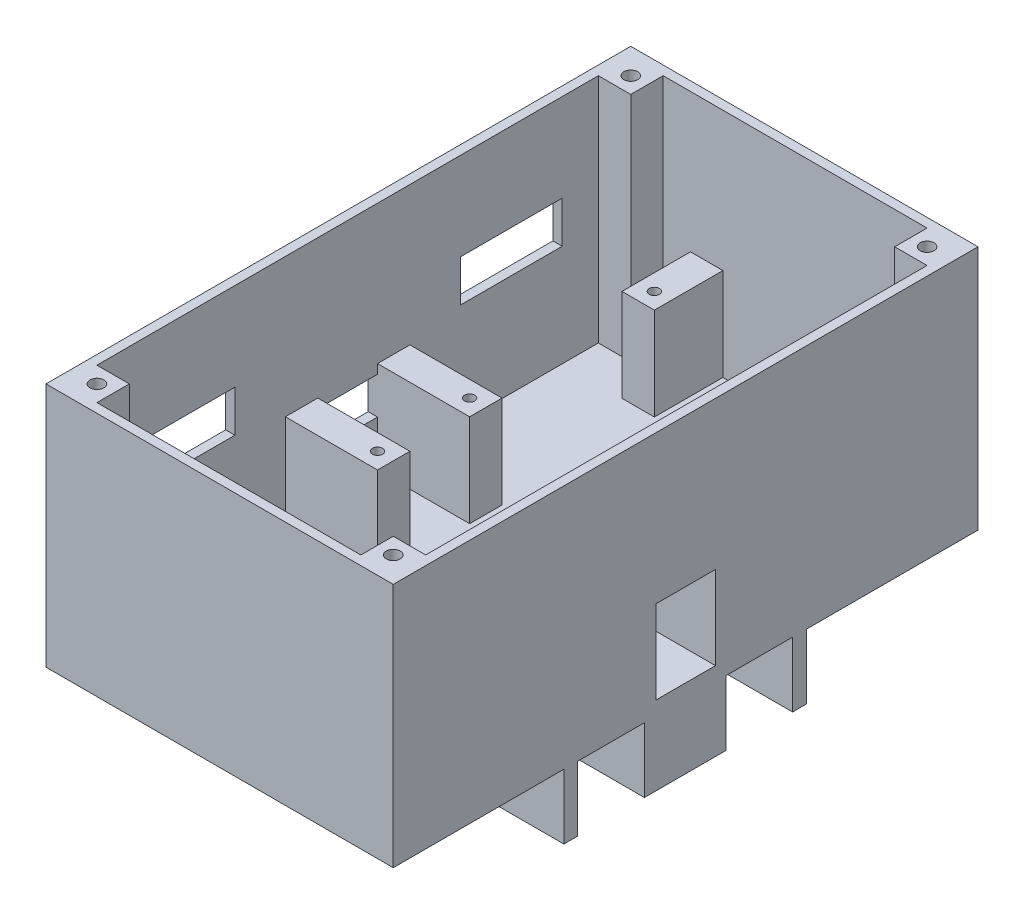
from build123d import *

# Parameters (mm, degrees)
SKETCH_1_W          = 50
SKETCH_1_H          = 8
SKETCH_1_W_2        = 7
SKETCH_1_H_2        = 7
SKETCH_1_H_3        = 10.3
SKETCH_1_H_4        = 50
SKETCH_1_R          = 1.1
EXTRUDE_1_DEPTH     = 3
SKETCH_2_W          = 12.5
SKETCH_2_H          = 126.3
EXTRUDE_2_DEPTH     = 3
SKETCH_3_W          = 3
SKETCH_3_H          = 14
EXTRUDE_3_DEPTH     = 75
SKETCH_4_W          = 3
SKETCH_4_H          = 11.6
EXTRUDE_4_DEPTH     = 14
CUT_EXTRUDE_1_REACH = 115.107
SKETCH_5_R          = 1.6
SKETCH_1_3_W        = 7
SKETCH_1_3_H        = 7
SKETCH_1_3_R        = 1.1
EXTRUDE_10_DEPTH    = 23
SKETCH_6_W          = 75
SKETCH_6_H          = 126.3
SKETCH_6_W_2        = 71
SKETCH_6_H_2        = 122.3
EXTRUDE_11_DEPTH    = 50
SKETCH_7_W          = 22
SKETCH_7_H          = 9
SKETCH_7_W_2        = 12.9
SKETCH_7_H_2        = 8
CUT_EXTRUDE_2_DEPTH = 2
SKETCH_8_W          = 7
SKETCH_8_H          = 7.8
SKETCH_8_W_2        = 11.1
SKETCH_8_H_2        = 7
SKETCH_8_W_3        = 12.9
EXTRUDE_12_DEPTH    = 20
SKETCH_9_W          = 12.9
SKETCH_9_H          = 18
CUT_EXTRUDE_3_DEPTH = 2
SKETCH_10_W         = 7
SKETCH_10_H         = 7
SKETCH_10_R         = 1.5
EXTRUDE_13_DEPTH    = 50


with BuildPart() as part:
    # Sketch 1 → Extrude 1 (new body)
    # profile 1 of 39: a face of its own
    with BuildSketch(Plane(origin=(0, 0, 0), x_dir=(1, 0, 0), z_dir=(0, 1, 0))):
        with Locations((-30.555555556, 21.400419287)):
            Rectangle(SKETCH_1_W, SKETCH_1_H)
    # profile 2 of 39: a face of its own
    with BuildSketch(Plane(origin=(0, 0, 0), x_dir=(1, 0, 0), z_dir=(0, 1, 0))):
        Polygon((-5.555555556, 17.400419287), (-55.555555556, 17.400419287), (-55.555555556, 17.200419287), (-55.555555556, -32.599580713), (-5.555555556, -32.599580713), align=None)
        with Locations((-49.655555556, -27.799580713)):
            Rectangle(SKETCH_1_W_2, SKETCH_1_H_2, mode=Mode.SUBTRACT)
        Polygon((-49.655555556, -18.743333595), (-46.732478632, -19.332275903), (-46.732478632, -19.801025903), (-49.655555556, -19.212083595), align=None, mode=Mode.SUBTRACT)
        with BuildLine():
            Line((-49.655555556, -16.025384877), (-46.732478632, -16.614327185))
            Line((-46.732478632, -16.614327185), (-46.732478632, -17.082275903))
            Line((-46.732478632, -17.082275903), (-47.911965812, -16.848301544))
            Line((-47.911965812, -16.848301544), (-47.911965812, -17.353109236))
            add(Edge.make_bspline(
                [(-47.911965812, -17.353109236), (-47.911952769, -17.392110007), (-47.911927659, -17.467197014), (-47.91638293, -17.575379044), (-47.921913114, -17.674753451), (-47.928601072, -17.765705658), (-47.938883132, -17.847796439), (-47.951958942, -17.9212223), (-47.965795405, -17.986168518), (-47.987873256, -18.060336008), (-48.024108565, -18.143233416), (-48.083801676, -18.231217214), (-48.158221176, -18.308153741), (-48.24694992, -18.371749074), (-48.345049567, -18.42274175), (-48.45023481, -18.459721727), (-48.561038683, -18.483184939), (-48.637008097, -18.485664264), (-48.675587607, -18.486923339)],
                knots=[0, 0, 0, 0, 1.18966585, 2.290427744, 3.302413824, 4.226076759, 5.072000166, 5.824860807, 6.50096546, 7.096453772, 8.183559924, 9.24573714, 10.323304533, 11.431580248, 12.561363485, 13.684988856, 14.824369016, 16, 16, 16, 16], degree=3))
            add(Edge.make_bspline(
                [(-48.675587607, -18.486923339), (-48.722478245, -18.484798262), (-48.816119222, -18.480554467), (-48.955005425, -18.449768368), (-49.090283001, -18.398580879), (-49.198440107, -18.340632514), (-49.281260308, -18.287231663), (-49.337871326, -18.242985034), (-49.389674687, -18.19708809), (-49.436296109, -18.149107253), (-49.477477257, -18.09850858), (-49.512483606, -18.045289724), (-49.543761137, -17.990571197), (-49.568537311, -17.931757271), (-49.589964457, -17.867795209), (-49.606782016, -17.796586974), (-49.622522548, -17.71756682), (-49.63355274, -17.630201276), (-49.644824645, -17.534961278), (-49.650357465, -17.431149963), (-49.654575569, -17.319491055), (-49.65522224, -17.242270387), (-49.655555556, -17.20246821)],
                knots=[0, 0, 0, 0, 1.521867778, 3.039182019, 4.595235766, 6.205262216, 7.013480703, 7.792365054, 8.535623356, 9.259347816, 9.962301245, 10.650221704, 11.325785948, 12.005622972, 12.718668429, 13.513751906, 14.379482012, 15.33369254, 16.371858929, 17.492759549, 18.707682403, 20, 20, 20, 20], degree=3))
            Line((-49.655555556, -17.20246821), (-49.655555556, -16.025384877))
        make_face(mode=Mode.SUBTRACT)
        Polygon((-49.655555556, -12.230513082), (-46.732478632, -12.81945539), (-46.732478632, -13.51496821), (-49.06340812, -13.789006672), (-46.732478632, -15.075865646), (-46.732478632, -15.750545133), (-49.655555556, -15.161602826), (-49.655555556, -14.692051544), (-47.299786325, -15.166410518), (-49.655555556, -13.865929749), (-49.655555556, -13.493333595), (-47.167574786, -13.200865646), (-49.655555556, -12.700064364), align=None, mode=Mode.SUBTRACT)
        Polygon((-49.655555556, -8.435641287), (-46.732478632, -9.024583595), (-46.732478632, -9.720096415), (-49.06340812, -9.994134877), (-46.732478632, -11.280993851), (-46.732478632, -11.955673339), (-49.655555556, -11.366731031), (-49.655555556, -10.897179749), (-47.299786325, -11.371538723), (-49.655555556, -10.071057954), (-49.655555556, -9.6984618), (-47.167574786, -9.405993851), (-49.655555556, -8.905192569), align=None, mode=Mode.SUBTRACT)
        with BuildLine():
            add(Edge.make_bspline(
                [(-49.347863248, -6.526987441), (-49.346005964, -6.570218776), (-49.342260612, -6.657397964), (-49.306487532, -6.786140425), (-49.25369311, -6.914499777), (-49.19076528, -7.016969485), (-49.132525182, -7.097686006), (-49.081387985, -7.154134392), (-49.026879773, -7.20862221), (-48.966547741, -7.258510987), (-48.902536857, -7.306322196), (-48.833064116, -7.349329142), (-48.759523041, -7.389861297), (-48.707560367, -7.412790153), (-48.681196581, -7.424423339)],
                knots=[0, 0, 0, 0, 1.313044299, 2.647851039, 4.03980324, 5.527339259, 6.29475363, 7.066375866, 7.842396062, 8.63863277, 9.446691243, 10.272184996, 11.123375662, 12, 12, 12, 12], degree=3))
            Line((-48.681196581, -7.424423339), (-48.732478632, -7.900384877))
            add(Edge.make_bspline(
                [(-48.732478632, -7.900384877), (-48.761539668, -7.891077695), (-48.820221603, -7.872284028), (-48.905561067, -7.832957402), (-48.989464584, -7.785309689), (-49.073397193, -7.730750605), (-49.155963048, -7.667327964), (-49.236737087, -7.594664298), (-49.316923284, -7.514603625), (-49.394780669, -7.427089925), (-49.468560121, -7.334067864), (-49.531962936, -7.23394987), (-49.585768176, -7.129596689), (-49.630014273, -7.02098967), (-49.66464566, -6.908109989), (-49.68958493, -6.790717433), (-49.704102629, -6.668648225), (-49.705918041, -6.58578652), (-49.706837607, -6.543814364)],
                knots=[0, 0, 0, 0, 0.821451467, 1.65872824, 2.5253579, 3.419452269, 4.353479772, 5.326892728, 6.34448713, 7.404545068, 8.481177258, 9.539108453, 10.591445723, 11.640358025, 12.694170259, 13.768130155, 14.869485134, 16, 16, 16, 16], degree=3))
            add(Edge.make_bspline(
                [(-49.706837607, -6.543814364), (-49.704871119, -6.491624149), (-49.700981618, -6.388397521), (-49.673628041, -6.237022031), (-49.626182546, -6.09264754), (-49.561767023, -5.95600294), (-49.479773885, -5.829392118), (-49.378253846, -5.71885502), (-49.260665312, -5.623732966), (-49.126611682, -5.546628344), (-48.980068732, -5.484575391), (-48.821704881, -5.442165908), (-48.654109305, -5.414670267), (-48.538948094, -5.411580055), (-48.480074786, -5.410000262)],
                knots=[0, 0, 0, 0, 0.998746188, 1.975412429, 2.932455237, 3.899737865, 4.859643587, 5.807715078, 6.760186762, 7.743054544, 8.758010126, 9.797314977, 10.873932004, 12, 12, 12, 12], degree=3))
            add(Edge.make_bspline(
                [(-48.480074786, -5.410000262), (-48.440787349, -5.410548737), (-48.362073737, -5.411647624), (-48.24466125, -5.422667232), (-48.127947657, -5.43921835), (-48.012338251, -5.463361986), (-47.897707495, -5.494882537), (-47.783968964, -5.532415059), (-47.671092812, -5.576834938), (-47.560029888, -5.627552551), (-47.453102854, -5.683849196), (-47.351891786, -5.744069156), (-47.258620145, -5.809112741), (-47.171220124, -5.876799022), (-47.092697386, -5.950509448), (-47.020274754, -6.027241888), (-46.955066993, -6.108377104), (-46.897762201, -6.193539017), (-46.846105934, -6.280779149), (-46.802082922, -6.370599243), (-46.765192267, -6.462299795), (-46.734706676, -6.555453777), (-46.710314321, -6.650125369), (-46.693817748, -6.746891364), (-46.682794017, -6.845374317), (-46.681731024, -6.91183974), (-46.681196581, -6.945256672)],
                knots=[0, 0, 0, 0, 1.076053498, 2.155906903, 3.227997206, 4.304324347, 5.388927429, 6.483432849, 7.584085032, 8.710486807, 9.826621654, 10.893304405, 11.934586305, 12.940267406, 13.918856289, 14.881752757, 15.829120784, 16.76677429, 17.691692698, 18.604725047, 19.504257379, 20.397457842, 21.288377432, 22.179807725, 23.084858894, 24, 24, 24, 24], degree=3))
            add(Edge.make_bspline(
                [(-46.681196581, -6.945256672), (-46.682001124, -6.987240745), (-46.683569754, -7.069097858), (-46.699275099, -7.188746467), (-46.724593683, -7.301757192), (-46.760373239, -7.408430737), (-46.804585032, -7.509373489), (-46.861880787, -7.602637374), (-46.927305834, -7.690377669), (-47.003006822, -7.770539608), (-47.087054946, -7.842947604), (-47.179600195, -7.905240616), (-47.279006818, -7.958842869), (-47.386062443, -8.001912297), (-47.500387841, -8.035598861), (-47.622158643, -8.059448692), (-47.751085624, -8.074041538), (-47.839544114, -8.075779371), (-47.884722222, -8.076666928)],
                knots=[0, 0, 0, 0, 1.079046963, 2.103837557, 3.096836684, 4.05243738, 4.993138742, 5.923631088, 6.860413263, 7.802993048, 8.752776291, 9.707117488, 10.665798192, 11.651646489, 12.668651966, 13.725973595, 14.838594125, 16, 16, 16, 16], degree=3))
            add(Edge.make_bspline(
                [(-47.884722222, -8.076666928), (-47.956692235, -8.074888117), (-48.10328767, -8.071264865), (-48.24836805, -8.049888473), (-48.322222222, -8.039006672)],
                knots=[0, 0, 0, 0, 0.981886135, 2, 2, 2, 2], degree=3))
            Line((-48.322222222, -8.039006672), (-48.322222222, -5.922820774))
            add(Edge.make_bspline(
                [(-48.322222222, -5.922820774), (-48.336503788, -5.915052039), (-48.363429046, -5.900405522), (-48.404371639, -5.883770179), (-48.443261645, -5.87372164), (-48.468807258, -5.872239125), (-48.480876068, -5.871538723)],
                knots=[0, 0, 0, 0, 1.156942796, 2.181202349, 3.140724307, 4, 4, 4, 4], degree=3))
            add(Edge.make_bspline(
                [(-48.480876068, -5.871538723), (-48.515084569, -5.872172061), (-48.581482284, -5.873401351), (-48.677844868, -5.88235239), (-48.768186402, -5.896493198), (-48.852266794, -5.91693801), (-48.929901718, -5.944568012), (-49.0015073, -5.977518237), (-49.067743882, -6.015441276), (-49.126037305, -6.060941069), (-49.178044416, -6.109529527), (-49.223519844, -6.161281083), (-49.261763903, -6.215613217), (-49.29407282, -6.272462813), (-49.317434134, -6.332616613), (-49.335660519, -6.394963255), (-49.346216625, -6.460119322), (-49.347309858, -6.504514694), (-49.347863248, -6.526987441)],
                knots=[0, 0, 0, 0, 1.346639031, 2.613787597, 3.806634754, 4.944106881, 6.015035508, 7.04544565, 8.044582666, 9.012064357, 9.949418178, 10.843667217, 11.718919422, 12.561537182, 13.410951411, 14.253044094, 15.115698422, 16, 16, 16, 16], degree=3))
        make_face(mode=Mode.SUBTRACT)
        with BuildLine():
            Line((-48.642735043, -2.605513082), (-46.732478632, -2.973301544))
            Line((-46.732478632, -2.973301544), (-46.732478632, -5.071057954))
            Line((-46.732478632, -5.071057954), (-49.655555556, -4.494936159))
            Line((-49.655555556, -4.494936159), (-49.655555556, -4.025384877))
            Line((-49.655555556, -4.025384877), (-47.091452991, -4.530993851))
            Line((-47.091452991, -4.530993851), (-47.091452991, -3.371538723))
            Line((-47.091452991, -3.371538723), (-48.940010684, -3.012564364))
            add(Edge.make_bspline(
                [(-48.940010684, -3.012564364), (-48.977999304, -3.004825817), (-49.050776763, -2.99000054), (-49.154548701, -2.964317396), (-49.248164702, -2.937004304), (-49.330907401, -2.905845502), (-49.404208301, -2.875671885), (-49.466652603, -2.841633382), (-49.519068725, -2.805969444), (-49.575196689, -2.755616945), (-49.628817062, -2.68156006), (-49.675113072, -2.580320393), (-49.702603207, -2.464310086), (-49.705382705, -2.382375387), (-49.706837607, -2.339487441)],
                knots=[0, 0, 0, 0, 1.225725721, 2.348208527, 3.379591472, 4.306785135, 5.142927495, 5.88367593, 6.551347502, 7.143312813, 8.259806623, 9.412386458, 10.645538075, 12, 12, 12, 12], degree=3))
            add(Edge.make_bspline(
                [(-49.706837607, -2.339487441), (-49.70660386, -2.311163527), (-49.706100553, -2.250176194), (-49.698577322, -2.152448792), (-49.689427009, -2.041793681), (-49.680369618, -1.963930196), (-49.675587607, -1.922820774)],
                knots=[0, 0, 0, 0, 0.81281446, 1.750160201, 2.812156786, 4, 4, 4, 4], degree=3))
            Line((-49.675587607, -1.922820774), (-49.339049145, -2.011763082))
            add(Edge.make_bspline(
                [(-49.339049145, -2.011763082), (-49.341513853, -2.04673822), (-49.346195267, -2.11316926), (-49.347327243, -2.17975375), (-49.347863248, -2.211282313)],
                knots=[0, 0, 0, 0, 1.052975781, 2, 2, 2, 2], degree=3))
            add(Edge.make_bspline(
                [(-49.347863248, -2.211282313), (-49.346937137, -2.238954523), (-49.345236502, -2.289769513), (-49.325715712, -2.35860164), (-49.294705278, -2.414046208), (-49.253545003, -2.446714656), (-49.21050684, -2.464618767), (-49.166349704, -2.48055397), (-49.109662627, -2.49815468), (-49.040461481, -2.517160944), (-48.958560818, -2.536851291), (-48.864564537, -2.558597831), (-48.75797054, -2.581766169), (-48.682547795, -2.597308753), (-48.642735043, -2.605513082)],
                knots=[0, 0, 0, 0, 1.110091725, 2.038481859, 2.852995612, 3.624933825, 4.096256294, 4.725104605, 5.513543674, 6.483296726, 7.611750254, 8.901983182, 10.364676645, 12, 12, 12, 12], degree=3))
        make_face(mode=Mode.SUBTRACT)
        with BuildLine():
            Line((-49.655555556, 1.000256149), (-45.655555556, 0.186954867))
            Line((-45.655555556, 0.186954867), (-45.655555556, -0.280993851))
            Line((-45.655555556, -0.280993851), (-47.296581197, 0.074775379))
            add(Edge.make_bspline(
                [(-47.296581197, 0.074775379), (-47.295807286, 0.034420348), (-47.294333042, -0.042452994), (-47.283467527, -0.152166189), (-47.264288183, -0.250315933), (-47.237968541, -0.339888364), (-47.198414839, -0.424440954), (-47.143552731, -0.50748337), (-47.074913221, -0.593552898), (-46.991438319, -0.681344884), (-46.893010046, -0.769926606), (-46.781280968, -0.860668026), (-46.655490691, -0.952390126), (-46.565777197, -1.012103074), (-46.519337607, -1.043013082)],
                knots=[0, 0, 0, 0, 1.009600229, 1.923213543, 2.754095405, 3.508736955, 4.253161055, 5.079867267, 5.99304058, 7.004629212, 8.106825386, 9.303894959, 10.604379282, 12, 12, 12, 12], degree=3))
            add(Edge.make_bspline(
                [(-46.519337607, -1.043013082), (-46.479515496, -1.066473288), (-46.403147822, -1.111463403), (-46.29429436, -1.176520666), (-46.197420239, -1.238145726), (-46.110465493, -1.29253244), (-46.036146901, -1.344064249), (-45.972807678, -1.390036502), (-45.919207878, -1.429173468), (-45.865201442, -1.477462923), (-45.807779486, -1.536356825), (-45.751922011, -1.614472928), (-45.703404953, -1.698183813), (-45.66792613, -1.789196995), (-45.640288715, -1.882702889), (-45.619076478, -1.976015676), (-45.606648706, -2.0691179), (-45.605063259, -2.130851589), (-45.604273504, -2.161602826)],
                knots=[0, 0, 0, 0, 1.443073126, 2.767410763, 3.958987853, 5.0277446, 5.969192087, 6.781572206, 7.47206887, 8.039259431, 9.041980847, 10.032771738, 11.02989452, 12.055043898, 13.073455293, 14.072946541, 15.040082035, 16, 16, 16, 16], degree=3))
            add(Edge.make_bspline(
                [(-45.604273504, -2.161602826), (-45.604210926, -2.165077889), (-45.604037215, -2.174724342), (-45.606511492, -2.193347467), (-45.607386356, -2.22038529), (-45.610125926, -2.255622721), (-45.613217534, -2.299166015), (-45.617522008, -2.350941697), (-45.620971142, -2.41111788), (-45.624717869, -2.453812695), (-45.626709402, -2.476506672)],
                knots=[0, 0, 0, 0, 0.26393131, 0.732648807, 1.424123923, 2.319503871, 3.418837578, 4.742392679, 6.268453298, 8, 8, 8, 8], degree=3))
            Line((-45.626709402, -2.476506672), (-46.085844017, -2.384359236))
            add(Edge.make_bspline(
                [(-46.085844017, -2.384359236), (-46.085436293, -2.371263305), (-46.084385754, -2.337520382), (-46.080816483, -2.303943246), (-46.078632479, -2.283397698)],
                knots=[0, 0, 0, 0, 0.776217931, 2, 2, 2, 2], degree=3))
            add(Edge.make_bspline(
                [(-46.078632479, -2.283397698), (-46.076702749, -2.26630955), (-46.073177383, -2.235091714), (-46.069231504, -2.192883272), (-46.066522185, -2.160033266), (-46.066019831, -2.141306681), (-46.065811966, -2.133557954)],
                knots=[0, 0, 0, 0, 1.371691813, 2.505903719, 3.381769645, 4, 4, 4, 4], degree=3))
            add(Edge.make_bspline(
                [(-46.065811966, -2.133557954), (-46.067144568, -2.110480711), (-46.069772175, -2.064977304), (-46.087706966, -1.998876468), (-46.118978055, -1.937277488), (-46.147918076, -1.901244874), (-46.162767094, -1.882756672)],
                knots=[0, 0, 0, 0, 1.007294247, 1.986169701, 2.966711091, 4, 4, 4, 4], degree=3))
            add(Edge.make_bspline(
                [(-46.162767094, -1.882756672), (-46.182222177, -1.862664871), (-46.225813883, -1.817646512), (-46.306015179, -1.751011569), (-46.406585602, -1.677684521), (-46.481452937, -1.628158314), (-46.521741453, -1.601506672)],
                knots=[0, 0, 0, 0, 0.733720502, 1.643998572, 2.732159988, 4, 4, 4, 4], degree=3))
            add(Edge.make_bspline(
                [(-46.521741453, -1.601506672), (-46.565884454, -1.574648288), (-46.651048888, -1.522830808), (-46.772763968, -1.446160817), (-46.883521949, -1.373066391), (-46.983654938, -1.304457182), (-47.072838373, -1.239772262), (-47.150410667, -1.178549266), (-47.21848833, -1.12300686), (-47.292528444, -1.053012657), (-47.37171795, -0.964232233), (-47.447351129, -0.847680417), (-47.506808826, -0.721878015), (-47.531078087, -0.632416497), (-47.543376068, -0.587083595)],
                knots=[0, 0, 0, 0, 1.254438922, 2.420170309, 3.492042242, 4.475883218, 5.366901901, 6.165945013, 6.874960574, 7.498802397, 8.63826863, 9.753341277, 10.861548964, 12, 12, 12, 12], degree=3))
            add(Edge.make_bspline(
                [(-47.543376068, -0.587083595), (-47.566391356, -0.613465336), (-47.615152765, -0.669359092), (-47.703020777, -0.747971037), (-47.805596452, -0.829044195), (-47.925044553, -0.910076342), (-48.058931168, -0.99446197), (-48.208888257, -1.080042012), (-48.375098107, -1.166153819), (-48.491693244, -1.222771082), (-48.552190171, -1.252147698)],
                knots=[0, 0, 0, 0, 0.690105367, 1.462093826, 2.321233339, 3.268343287, 4.30778059, 5.443022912, 6.67327866, 8, 8, 8, 8], degree=3))
            Line((-48.552190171, -1.252147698), (-49.655555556, -1.768974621))
            Line((-49.655555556, -1.768974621), (-49.655555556, -1.275384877))
            Line((-49.655555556, -1.275384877), (-48.710844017, -0.832275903))
            add(Edge.make_bspline(
                [(-48.710844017, -0.832275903), (-48.665868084, -0.810854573), (-48.579478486, -0.769708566), (-48.456662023, -0.707020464), (-48.345234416, -0.646955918), (-48.245099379, -0.589982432), (-48.157644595, -0.53416039), (-48.080780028, -0.482451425), (-48.015876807, -0.432258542), (-47.961106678, -0.383049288), (-47.915124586, -0.332543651), (-47.876154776, -0.277800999), (-47.842516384, -0.218501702), (-47.814364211, -0.1540335), (-47.792263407, -0.084643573), (-47.774200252, -0.010866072), (-47.763425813, 0.068099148), (-47.759918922, 0.122291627), (-47.758119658, 0.150095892)],
                knots=[0, 0, 0, 0, 1.636856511, 3.144067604, 4.53023304, 5.796252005, 6.928436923, 7.938672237, 8.839265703, 9.622085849, 10.355319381, 11.078664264, 11.825429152, 12.591792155, 13.385555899, 14.215746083, 15.084561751, 16, 16, 16, 16], degree=3))
            Line((-47.758119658, 0.150095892), (-49.655555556, 0.531506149))
            Line((-49.655555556, 0.531506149), (-49.655555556, 1.000256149))
        make_face(mode=Mode.SUBTRACT)
        with Locations((-49.655555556, 12.100419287)):
            Rectangle(SKETCH_1_W_2, SKETCH_1_H_2, mode=Mode.SUBTRACT)
        with Locations((-9.655555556, -27.799580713)):
            Rectangle(SKETCH_1_W_2, SKETCH_1_H_2, mode=Mode.SUBTRACT)
        with Locations((-9.655555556, 12.100419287)):
            Rectangle(SKETCH_1_W_2, SKETCH_1_H_2, mode=Mode.SUBTRACT)
    # profile 3 of 39: a face of its own
    with BuildSketch(Plane(origin=(0, 0, 0), x_dir=(1, 0, 0), z_dir=(0, 1, 0))):
        with Locations((-30.555555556, -37.749580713)):
            Rectangle(SKETCH_1_W, SKETCH_1_H_3)
    # profile 4 of 39: a face of its own
    with BuildSketch(Plane(origin=(0, 0, 0), x_dir=(1, 0, 0), z_dir=(0, 1, 0))):
        with Locations((-30.555555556, -67.899580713)):
            Rectangle(SKETCH_1_W, SKETCH_1_H_4)
        with Locations((-49.655555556, -87.599580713)):
            Rectangle(SKETCH_1_W_2, SKETCH_1_H_2, mode=Mode.SUBTRACT)
        Polygon((-49.655555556, -78.743333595), (-46.732478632, -79.332275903), (-46.732478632, -79.801025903), (-49.655555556, -79.212083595), align=None, mode=Mode.SUBTRACT)
        with BuildLine():
            Line((-49.655555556, -76.025384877), (-46.732478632, -76.614327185))
            Line((-46.732478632, -76.614327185), (-46.732478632, -77.082275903))
            Line((-46.732478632, -77.082275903), (-47.911965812, -76.848301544))
            Line((-47.911965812, -76.848301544), (-47.911965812, -77.353109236))
            add(Edge.make_bspline(
                [(-47.911965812, -77.353109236), (-47.911952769, -77.392110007), (-47.911927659, -77.467197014), (-47.91638293, -77.575379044), (-47.921913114, -77.674753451), (-47.928601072, -77.765705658), (-47.938883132, -77.847796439), (-47.951958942, -77.9212223), (-47.965795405, -77.986168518), (-47.987873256, -78.060336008), (-48.024108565, -78.143233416), (-48.083801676, -78.231217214), (-48.158221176, -78.308153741), (-48.24694992, -78.371749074), (-48.345049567, -78.42274175), (-48.45023481, -78.459721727), (-48.561038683, -78.483184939), (-48.637008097, -78.485664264), (-48.675587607, -78.486923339)],
                knots=[0, 0, 0, 0, 1.18966585, 2.290427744, 3.302413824, 4.226076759, 5.072000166, 5.824860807, 6.50096546, 7.096453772, 8.183559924, 9.24573714, 10.323304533, 11.431580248, 12.561363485, 13.684988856, 14.824369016, 16, 16, 16, 16], degree=3))
            add(Edge.make_bspline(
                [(-48.675587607, -78.486923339), (-48.722478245, -78.484798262), (-48.816119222, -78.480554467), (-48.955005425, -78.449768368), (-49.090283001, -78.398580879), (-49.198440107, -78.340632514), (-49.281260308, -78.287231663), (-49.337871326, -78.242985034), (-49.389674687, -78.19708809), (-49.436296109, -78.149107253), (-49.477477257, -78.09850858), (-49.512483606, -78.045289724), (-49.543761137, -77.990571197), (-49.568537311, -77.931757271), (-49.589964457, -77.867795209), (-49.606782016, -77.796586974), (-49.622522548, -77.71756682), (-49.63355274, -77.630201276), (-49.644824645, -77.534961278), (-49.650357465, -77.431149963), (-49.654575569, -77.319491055), (-49.65522224, -77.242270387), (-49.655555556, -77.20246821)],
                knots=[0, 0, 0, 0, 1.521867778, 3.039182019, 4.595235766, 6.205262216, 7.013480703, 7.792365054, 8.535623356, 9.259347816, 9.962301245, 10.650221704, 11.325785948, 12.005622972, 12.718668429, 13.513751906, 14.379482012, 15.33369254, 16.371858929, 17.492759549, 18.707682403, 20, 20, 20, 20], degree=3))
            Line((-49.655555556, -77.20246821), (-49.655555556, -76.025384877))
        make_face(mode=Mode.SUBTRACT)
        Polygon((-49.655555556, -72.230513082), (-46.732478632, -72.81945539), (-46.732478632, -73.51496821), (-49.06340812, -73.789006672), (-46.732478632, -75.075865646), (-46.732478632, -75.750545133), (-49.655555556, -75.161602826), (-49.655555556, -74.692051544), (-47.299786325, -75.166410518), (-49.655555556, -73.865929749), (-49.655555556, -73.493333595), (-47.167574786, -73.200865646), (-49.655555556, -72.700064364), align=None, mode=Mode.SUBTRACT)
        Polygon((-49.655555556, -68.435641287), (-46.732478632, -69.024583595), (-46.732478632, -69.720096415), (-49.06340812, -69.994134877), (-46.732478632, -71.280993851), (-46.732478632, -71.955673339), (-49.655555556, -71.366731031), (-49.655555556, -70.897179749), (-47.299786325, -71.371538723), (-49.655555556, -70.071057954), (-49.655555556, -69.6984618), (-47.167574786, -69.405993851), (-49.655555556, -68.905192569), align=None, mode=Mode.SUBTRACT)
        with BuildLine():
            add(Edge.make_bspline(
                [(-49.347863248, -66.526987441), (-49.346005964, -66.570218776), (-49.342260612, -66.657397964), (-49.306487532, -66.786140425), (-49.25369311, -66.914499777), (-49.19076528, -67.016969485), (-49.132525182, -67.097686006), (-49.081387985, -67.154134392), (-49.026879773, -67.20862221), (-48.966547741, -67.258510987), (-48.902536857, -67.306322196), (-48.833064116, -67.349329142), (-48.759523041, -67.389861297), (-48.707560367, -67.412790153), (-48.681196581, -67.424423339)],
                knots=[0, 0, 0, 0, 1.313044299, 2.647851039, 4.03980324, 5.527339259, 6.29475363, 7.066375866, 7.842396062, 8.63863277, 9.446691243, 10.272184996, 11.123375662, 12, 12, 12, 12], degree=3))
            Line((-48.681196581, -67.424423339), (-48.732478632, -67.900384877))
            add(Edge.make_bspline(
                [(-48.732478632, -67.900384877), (-48.761539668, -67.891077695), (-48.820221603, -67.872284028), (-48.905561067, -67.832957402), (-48.989464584, -67.785309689), (-49.073397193, -67.730750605), (-49.155963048, -67.667327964), (-49.236737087, -67.594664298), (-49.316923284, -67.514603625), (-49.394780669, -67.427089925), (-49.468560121, -67.334067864), (-49.531962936, -67.23394987), (-49.585768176, -67.129596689), (-49.630014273, -67.02098967), (-49.66464566, -66.908109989), (-49.68958493, -66.790717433), (-49.704102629, -66.668648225), (-49.705918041, -66.58578652), (-49.706837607, -66.543814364)],
                knots=[0, 0, 0, 0, 0.821451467, 1.65872824, 2.5253579, 3.419452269, 4.353479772, 5.326892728, 6.34448713, 7.404545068, 8.481177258, 9.539108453, 10.591445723, 11.640358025, 12.694170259, 13.768130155, 14.869485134, 16, 16, 16, 16], degree=3))
            add(Edge.make_bspline(
                [(-49.706837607, -66.543814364), (-49.704871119, -66.491624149), (-49.700981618, -66.388397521), (-49.673628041, -66.237022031), (-49.626182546, -66.09264754), (-49.561767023, -65.95600294), (-49.479773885, -65.829392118), (-49.378253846, -65.71885502), (-49.260665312, -65.623732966), (-49.126611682, -65.546628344), (-48.980068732, -65.484575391), (-48.821704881, -65.442165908), (-48.654109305, -65.414670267), (-48.538948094, -65.411580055), (-48.480074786, -65.410000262)],
                knots=[0, 0, 0, 0, 0.998746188, 1.975412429, 2.932455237, 3.899737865, 4.859643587, 5.807715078, 6.760186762, 7.743054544, 8.758010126, 9.797314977, 10.873932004, 12, 12, 12, 12], degree=3))
            add(Edge.make_bspline(
                [(-48.480074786, -65.410000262), (-48.440787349, -65.410548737), (-48.362073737, -65.411647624), (-48.24466125, -65.422667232), (-48.127947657, -65.43921835), (-48.012338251, -65.463361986), (-47.897707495, -65.494882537), (-47.783968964, -65.532415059), (-47.671092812, -65.576834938), (-47.560029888, -65.627552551), (-47.453102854, -65.683849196), (-47.351891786, -65.744069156), (-47.258620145, -65.809112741), (-47.171220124, -65.876799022), (-47.092697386, -65.950509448), (-47.020274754, -66.027241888), (-46.955066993, -66.108377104), (-46.897762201, -66.193539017), (-46.846105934, -66.280779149), (-46.802082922, -66.370599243), (-46.765192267, -66.462299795), (-46.734706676, -66.555453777), (-46.710314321, -66.650125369), (-46.693817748, -66.746891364), (-46.682794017, -66.845374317), (-46.681731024, -66.91183974), (-46.681196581, -66.945256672)],
                knots=[0, 0, 0, 0, 1.076053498, 2.155906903, 3.227997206, 4.304324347, 5.388927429, 6.483432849, 7.584085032, 8.710486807, 9.826621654, 10.893304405, 11.934586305, 12.940267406, 13.918856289, 14.881752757, 15.829120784, 16.76677429, 17.691692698, 18.604725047, 19.504257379, 20.397457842, 21.288377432, 22.179807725, 23.084858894, 24, 24, 24, 24], degree=3))
            add(Edge.make_bspline(
                [(-46.681196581, -66.945256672), (-46.682001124, -66.987240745), (-46.683569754, -67.069097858), (-46.699275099, -67.188746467), (-46.724593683, -67.301757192), (-46.760373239, -67.408430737), (-46.804585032, -67.509373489), (-46.861880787, -67.602637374), (-46.927305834, -67.690377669), (-47.003006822, -67.770539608), (-47.087054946, -67.842947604), (-47.179600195, -67.905240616), (-47.279006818, -67.958842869), (-47.386062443, -68.001912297), (-47.500387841, -68.035598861), (-47.622158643, -68.059448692), (-47.751085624, -68.074041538), (-47.839544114, -68.075779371), (-47.884722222, -68.076666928)],
                knots=[0, 0, 0, 0, 1.079046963, 2.103837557, 3.096836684, 4.05243738, 4.993138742, 5.923631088, 6.860413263, 7.802993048, 8.752776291, 9.707117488, 10.665798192, 11.651646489, 12.668651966, 13.725973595, 14.838594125, 16, 16, 16, 16], degree=3))
            add(Edge.make_bspline(
                [(-47.884722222, -68.076666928), (-47.956692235, -68.074888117), (-48.10328767, -68.071264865), (-48.24836805, -68.049888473), (-48.322222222, -68.039006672)],
                knots=[0, 0, 0, 0, 0.981886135, 2, 2, 2, 2], degree=3))
            Line((-48.322222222, -68.039006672), (-48.322222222, -65.922820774))
            add(Edge.make_bspline(
                [(-48.322222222, -65.922820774), (-48.336503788, -65.915052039), (-48.363429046, -65.900405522), (-48.404371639, -65.883770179), (-48.443261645, -65.87372164), (-48.468807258, -65.872239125), (-48.480876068, -65.871538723)],
                knots=[0, 0, 0, 0, 1.156942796, 2.181202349, 3.140724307, 4, 4, 4, 4], degree=3))
            add(Edge.make_bspline(
                [(-48.480876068, -65.871538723), (-48.515084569, -65.872172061), (-48.581482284, -65.873401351), (-48.677844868, -65.88235239), (-48.768186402, -65.896493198), (-48.852266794, -65.91693801), (-48.929901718, -65.944568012), (-49.0015073, -65.977518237), (-49.067743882, -66.015441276), (-49.126037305, -66.060941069), (-49.178044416, -66.109529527), (-49.223519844, -66.161281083), (-49.261763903, -66.215613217), (-49.29407282, -66.272462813), (-49.317434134, -66.332616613), (-49.335660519, -66.394963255), (-49.346216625, -66.460119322), (-49.347309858, -66.504514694), (-49.347863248, -66.526987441)],
                knots=[0, 0, 0, 0, 1.346639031, 2.613787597, 3.806634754, 4.944106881, 6.015035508, 7.04544565, 8.044582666, 9.012064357, 9.949418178, 10.843667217, 11.718919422, 12.561537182, 13.410951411, 14.253044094, 15.115698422, 16, 16, 16, 16], degree=3))
        make_face(mode=Mode.SUBTRACT)
        with BuildLine():
            Line((-48.642735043, -62.605513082), (-46.732478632, -62.973301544))
            Line((-46.732478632, -62.973301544), (-46.732478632, -65.071057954))
            Line((-46.732478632, -65.071057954), (-49.655555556, -64.494936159))
            Line((-49.655555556, -64.494936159), (-49.655555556, -64.025384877))
            Line((-49.655555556, -64.025384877), (-47.091452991, -64.530993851))
            Line((-47.091452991, -64.530993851), (-47.091452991, -63.371538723))
            Line((-47.091452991, -63.371538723), (-48.940010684, -63.012564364))
            add(Edge.make_bspline(
                [(-48.940010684, -63.012564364), (-48.977999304, -63.004825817), (-49.050776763, -62.99000054), (-49.154548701, -62.964317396), (-49.248164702, -62.937004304), (-49.330907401, -62.905845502), (-49.404208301, -62.875671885), (-49.466652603, -62.841633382), (-49.519068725, -62.805969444), (-49.575196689, -62.755616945), (-49.628817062, -62.68156006), (-49.675113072, -62.580320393), (-49.702603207, -62.464310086), (-49.705382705, -62.382375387), (-49.706837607, -62.339487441)],
                knots=[0, 0, 0, 0, 1.225725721, 2.348208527, 3.379591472, 4.306785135, 5.142927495, 5.88367593, 6.551347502, 7.143312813, 8.259806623, 9.412386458, 10.645538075, 12, 12, 12, 12], degree=3))
            add(Edge.make_bspline(
                [(-49.706837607, -62.339487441), (-49.70660386, -62.311163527), (-49.706100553, -62.250176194), (-49.698577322, -62.152448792), (-49.689427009, -62.041793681), (-49.680369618, -61.963930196), (-49.675587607, -61.922820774)],
                knots=[0, 0, 0, 0, 0.81281446, 1.750160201, 2.812156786, 4, 4, 4, 4], degree=3))
            Line((-49.675587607, -61.922820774), (-49.339049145, -62.011763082))
            add(Edge.make_bspline(
                [(-49.339049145, -62.011763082), (-49.341513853, -62.04673822), (-49.346195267, -62.11316926), (-49.347327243, -62.17975375), (-49.347863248, -62.211282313)],
                knots=[0, 0, 0, 0, 1.052975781, 2, 2, 2, 2], degree=3))
            add(Edge.make_bspline(
                [(-49.347863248, -62.211282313), (-49.346937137, -62.238954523), (-49.345236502, -62.289769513), (-49.325715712, -62.35860164), (-49.294705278, -62.414046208), (-49.253545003, -62.446714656), (-49.21050684, -62.464618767), (-49.166349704, -62.48055397), (-49.109662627, -62.49815468), (-49.040461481, -62.517160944), (-48.958560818, -62.536851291), (-48.864564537, -62.558597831), (-48.75797054, -62.581766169), (-48.682547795, -62.597308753), (-48.642735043, -62.605513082)],
                knots=[0, 0, 0, 0, 1.110091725, 2.038481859, 2.852995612, 3.624933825, 4.096256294, 4.725104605, 5.513543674, 6.483296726, 7.611750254, 8.901983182, 10.364676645, 12, 12, 12, 12], degree=3))
        make_face(mode=Mode.SUBTRACT)
        with BuildLine():
            Line((-49.655555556, -58.999743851), (-45.655555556, -59.813045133))
            Line((-45.655555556, -59.813045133), (-45.655555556, -60.280993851))
            Line((-45.655555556, -60.280993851), (-47.296581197, -59.925224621))
            add(Edge.make_bspline(
                [(-47.296581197, -59.925224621), (-47.295807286, -59.965579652), (-47.294333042, -60.042452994), (-47.283467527, -60.152166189), (-47.264288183, -60.250315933), (-47.237968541, -60.339888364), (-47.198414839, -60.424440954), (-47.143552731, -60.50748337), (-47.074913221, -60.593552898), (-46.991438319, -60.681344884), (-46.893010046, -60.769926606), (-46.781280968, -60.860668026), (-46.655490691, -60.952390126), (-46.565777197, -61.012103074), (-46.519337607, -61.043013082)],
                knots=[0, 0, 0, 0, 1.009600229, 1.923213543, 2.754095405, 3.508736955, 4.253161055, 5.079867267, 5.99304058, 7.004629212, 8.106825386, 9.303894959, 10.604379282, 12, 12, 12, 12], degree=3))
            add(Edge.make_bspline(
                [(-46.519337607, -61.043013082), (-46.479515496, -61.066473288), (-46.403147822, -61.111463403), (-46.29429436, -61.176520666), (-46.197420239, -61.238145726), (-46.110465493, -61.29253244), (-46.036146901, -61.344064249), (-45.972807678, -61.390036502), (-45.919207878, -61.429173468), (-45.865201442, -61.477462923), (-45.807779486, -61.536356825), (-45.751922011, -61.614472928), (-45.703404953, -61.698183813), (-45.66792613, -61.789196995), (-45.640288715, -61.882702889), (-45.619076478, -61.976015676), (-45.606648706, -62.0691179), (-45.605063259, -62.130851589), (-45.604273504, -62.161602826)],
                knots=[0, 0, 0, 0, 1.443073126, 2.767410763, 3.958987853, 5.0277446, 5.969192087, 6.781572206, 7.47206887, 8.039259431, 9.041980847, 10.032771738, 11.02989452, 12.055043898, 13.073455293, 14.072946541, 15.040082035, 16, 16, 16, 16], degree=3))
            add(Edge.make_bspline(
                [(-45.604273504, -62.161602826), (-45.604210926, -62.165077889), (-45.604037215, -62.174724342), (-45.606511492, -62.193347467), (-45.607386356, -62.22038529), (-45.610125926, -62.255622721), (-45.613217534, -62.299166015), (-45.617522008, -62.350941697), (-45.620971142, -62.41111788), (-45.624717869, -62.453812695), (-45.626709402, -62.476506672)],
                knots=[0, 0, 0, 0, 0.26393131, 0.732648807, 1.424123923, 2.319503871, 3.418837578, 4.742392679, 6.268453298, 8, 8, 8, 8], degree=3))
            Line((-45.626709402, -62.476506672), (-46.085844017, -62.384359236))
            add(Edge.make_bspline(
                [(-46.085844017, -62.384359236), (-46.085436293, -62.371263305), (-46.084385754, -62.337520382), (-46.080816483, -62.303943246), (-46.078632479, -62.283397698)],
                knots=[0, 0, 0, 0, 0.776217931, 2, 2, 2, 2], degree=3))
            add(Edge.make_bspline(
                [(-46.078632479, -62.283397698), (-46.076702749, -62.26630955), (-46.073177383, -62.235091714), (-46.069231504, -62.192883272), (-46.066522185, -62.160033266), (-46.066019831, -62.141306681), (-46.065811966, -62.133557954)],
                knots=[0, 0, 0, 0, 1.371691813, 2.505903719, 3.381769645, 4, 4, 4, 4], degree=3))
            add(Edge.make_bspline(
                [(-46.065811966, -62.133557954), (-46.067144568, -62.110480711), (-46.069772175, -62.064977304), (-46.087706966, -61.998876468), (-46.118978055, -61.937277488), (-46.147918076, -61.901244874), (-46.162767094, -61.882756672)],
                knots=[0, 0, 0, 0, 1.007294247, 1.986169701, 2.966711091, 4, 4, 4, 4], degree=3))
            add(Edge.make_bspline(
                [(-46.162767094, -61.882756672), (-46.182222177, -61.862664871), (-46.225813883, -61.817646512), (-46.306015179, -61.751011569), (-46.406585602, -61.677684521), (-46.481452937, -61.628158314), (-46.521741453, -61.601506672)],
                knots=[0, 0, 0, 0, 0.733720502, 1.643998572, 2.732159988, 4, 4, 4, 4], degree=3))
            add(Edge.make_bspline(
                [(-46.521741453, -61.601506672), (-46.565884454, -61.574648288), (-46.651048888, -61.522830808), (-46.772763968, -61.446160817), (-46.883521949, -61.373066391), (-46.983654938, -61.304457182), (-47.072838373, -61.239772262), (-47.150410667, -61.178549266), (-47.21848833, -61.12300686), (-47.292528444, -61.053012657), (-47.37171795, -60.964232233), (-47.447351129, -60.847680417), (-47.506808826, -60.721878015), (-47.531078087, -60.632416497), (-47.543376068, -60.587083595)],
                knots=[0, 0, 0, 0, 1.254438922, 2.420170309, 3.492042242, 4.475883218, 5.366901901, 6.165945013, 6.874960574, 7.498802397, 8.63826863, 9.753341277, 10.861548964, 12, 12, 12, 12], degree=3))
            add(Edge.make_bspline(
                [(-47.543376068, -60.587083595), (-47.566391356, -60.613465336), (-47.615152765, -60.669359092), (-47.703020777, -60.747971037), (-47.805596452, -60.829044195), (-47.925044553, -60.910076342), (-48.058931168, -60.99446197), (-48.208888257, -61.080042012), (-48.375098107, -61.166153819), (-48.491693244, -61.222771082), (-48.552190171, -61.252147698)],
                knots=[0, 0, 0, 0, 0.690105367, 1.462093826, 2.321233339, 3.268343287, 4.30778059, 5.443022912, 6.67327866, 8, 8, 8, 8], degree=3))
            Line((-48.552190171, -61.252147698), (-49.655555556, -61.768974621))
            Line((-49.655555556, -61.768974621), (-49.655555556, -61.275384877))
            Line((-49.655555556, -61.275384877), (-48.710844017, -60.832275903))
            add(Edge.make_bspline(
                [(-48.710844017, -60.832275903), (-48.665868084, -60.810854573), (-48.579478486, -60.769708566), (-48.456662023, -60.707020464), (-48.345234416, -60.646955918), (-48.245099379, -60.589982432), (-48.157644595, -60.53416039), (-48.080780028, -60.482451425), (-48.015876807, -60.432258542), (-47.961106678, -60.383049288), (-47.915124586, -60.332543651), (-47.876154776, -60.277800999), (-47.842516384, -60.218501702), (-47.814364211, -60.1540335), (-47.792263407, -60.084643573), (-47.774200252, -60.010866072), (-47.763425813, -59.931900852), (-47.759918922, -59.877708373), (-47.758119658, -59.849904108)],
                knots=[0, 0, 0, 0, 1.636856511, 3.144067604, 4.53023304, 5.796252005, 6.928436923, 7.938672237, 8.839265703, 9.622085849, 10.355319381, 11.078664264, 11.825429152, 12.591792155, 13.385555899, 14.215746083, 15.084561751, 16, 16, 16, 16], degree=3))
            Line((-47.758119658, -59.849904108), (-49.655555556, -59.468493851))
            Line((-49.655555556, -59.468493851), (-49.655555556, -58.999743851))
        make_face(mode=Mode.SUBTRACT)
        with Locations((-49.655555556, -47.699580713)):
            Rectangle(SKETCH_1_W_2, SKETCH_1_H_2, mode=Mode.SUBTRACT)
        with Locations((-9.655555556, -87.599580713)):
            Rectangle(SKETCH_1_W_2, SKETCH_1_H_2, mode=Mode.SUBTRACT)
        with Locations((-9.655555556, -47.699580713)):
            Rectangle(SKETCH_1_W_2, SKETCH_1_H_2, mode=Mode.SUBTRACT)
    # profile 5 of 39: a face of its own
    with BuildSketch(Plane(origin=(0, 0, 0), x_dir=(1, 0, 0), z_dir=(0, 1, 0))):
        with Locations((-30.555555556, -96.899580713)):
            Rectangle(SKETCH_1_W, SKETCH_1_H)
    # profile 6 of 39: a face of its own
    with BuildSketch(Plane(origin=(0, 0, 0), x_dir=(1, 0, 0), z_dir=(0, 1, 0))):
        with Locations((-9.655555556, 12.100419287)):
            Rectangle(SKETCH_1_W_2, SKETCH_1_H_2)
        with Locations((-9.655555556, 12.100419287)):
            Circle(SKETCH_1_R, mode=Mode.SUBTRACT)
    # profile 7 of 39: a face of its own
    with BuildSketch(Plane(origin=(0, 0, 0), x_dir=(1, 0, 0), z_dir=(0, 1, 0))):
        with Locations((-49.655555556, 12.100419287)):
            Rectangle(SKETCH_1_W_2, SKETCH_1_H_2)
        with Locations((-49.655555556, 12.100419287)):
            Circle(SKETCH_1_R, mode=Mode.SUBTRACT)
    # profile 8 of 39: a face of its own
    with BuildSketch(Plane(origin=(0, 0, 0), x_dir=(1, 0, 0), z_dir=(0, 1, 0))):
        with Locations((-49.655555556, -27.799580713)):
            Rectangle(SKETCH_1_W_2, SKETCH_1_H_2)
        with Locations((-49.655555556, -27.799580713)):
            Circle(SKETCH_1_R, mode=Mode.SUBTRACT)
    # profile 9 of 39: a face of its own
    with BuildSketch(Plane(origin=(0, 0, 0), x_dir=(1, 0, 0), z_dir=(0, 1, 0))):
        with Locations((-9.655555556, -27.799580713)):
            Rectangle(SKETCH_1_W_2, SKETCH_1_H_2)
        with Locations((-9.655555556, -27.799580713)):
            Circle(SKETCH_1_R, mode=Mode.SUBTRACT)
    # profile 10 of 39: a face of its own
    with BuildSketch(Plane(origin=(0, 0, 0), x_dir=(1, 0, 0), z_dir=(0, 1, 0))):
        with Locations((-9.655555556, -47.699580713)):
            Rectangle(SKETCH_1_W_2, SKETCH_1_H_2)
        with Locations((-9.655555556, -47.699580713)):
            Circle(SKETCH_1_R, mode=Mode.SUBTRACT)
    # profile 11 of 39: a face of its own
    with BuildSketch(Plane(origin=(0, 0, 0), x_dir=(1, 0, 0), z_dir=(0, 1, 0))):
        with Locations((-49.655555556, -47.699580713)):
            Rectangle(SKETCH_1_W_2, SKETCH_1_H_2)
        with Locations((-49.655555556, -47.699580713)):
            Circle(SKETCH_1_R, mode=Mode.SUBTRACT)
    # profile 12 of 39: a face of its own
    with BuildSketch(Plane(origin=(0, 0, 0), x_dir=(1, 0, 0), z_dir=(0, 1, 0))):
        with Locations((-49.655555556, -87.599580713)):
            Rectangle(SKETCH_1_W_2, SKETCH_1_H_2)
        with Locations((-49.655555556, -87.599580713)):
            Circle(SKETCH_1_R, mode=Mode.SUBTRACT)
    # profile 13 of 39: a face of its own
    with BuildSketch(Plane(origin=(0, 0, 0), x_dir=(1, 0, 0), z_dir=(0, 1, 0))):
        with Locations((-9.655555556, -87.599580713)):
            Rectangle(SKETCH_1_W_2, SKETCH_1_H_2)
        with Locations((-9.655555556, -87.599580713)):
            Circle(SKETCH_1_R, mode=Mode.SUBTRACT)
    # profile 14 of 39: a face of its own
    with BuildSketch(Plane(origin=(0, 0, 0), x_dir=(1, 0, 0), z_dir=(0, 1, 0))):
        with Locations((-9.655555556, 12.100419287)):
            Circle(SKETCH_1_R)
    # profile 15 of 39: a face of its own
    with BuildSketch(Plane(origin=(0, 0, 0), x_dir=(1, 0, 0), z_dir=(0, 1, 0))):
        with Locations((-49.655555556, 12.100419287)):
            Circle(SKETCH_1_R)
    # profile 16 of 39: a face of its own
    with BuildSketch(Plane(origin=(0, 0, 0), x_dir=(1, 0, 0), z_dir=(0, 1, 0))):
        with Locations((-49.655555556, -27.799580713)):
            Circle(SKETCH_1_R)
    # profile 17 of 39: a face of its own
    with BuildSketch(Plane(origin=(0, 0, 0), x_dir=(1, 0, 0), z_dir=(0, 1, 0))):
        with Locations((-9.655555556, -27.799580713)):
            Circle(SKETCH_1_R)
    # profile 18 of 39: a face of its own
    with BuildSketch(Plane(origin=(0, 0, 0), x_dir=(1, 0, 0), z_dir=(0, 1, 0))):
        with Locations((-9.655555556, -47.699580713)):
            Circle(SKETCH_1_R)
    # profile 19 of 39: a face of its own
    with BuildSketch(Plane(origin=(0, 0, 0), x_dir=(1, 0, 0), z_dir=(0, 1, 0))):
        with Locations((-49.655555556, -47.699580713)):
            Circle(SKETCH_1_R)
    # profile 20 of 39: a face of its own
    with BuildSketch(Plane(origin=(0, 0, 0), x_dir=(1, 0, 0), z_dir=(0, 1, 0))):
        with Locations((-49.655555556, -87.599580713)):
            Circle(SKETCH_1_R)
    # profile 21 of 39: a face of its own
    with BuildSketch(Plane(origin=(0, 0, 0), x_dir=(1, 0, 0), z_dir=(0, 1, 0))):
        with Locations((-9.655555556, -87.599580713)):
            Circle(SKETCH_1_R)
    # profile 22 of 39: a face of its own
    with BuildSketch(Plane(origin=(0, 0, 0), x_dir=(1, 0, 0), z_dir=(0, 1, 0))):
        with BuildLine():
            Line((-45.655555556, -0.280993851), (-45.655555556, 0.186954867))
            Line((-45.655555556, 0.186954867), (-49.655555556, 1.000256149))
            Line((-49.655555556, 1.000256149), (-49.655555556, 0.531506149))
            Line((-49.655555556, 0.531506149), (-47.758119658, 0.150095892))
            add(Edge.make_bspline(
                [(-48.710844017, -0.832275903), (-48.665868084, -0.810854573), (-48.579478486, -0.769708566), (-48.456662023, -0.707020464), (-48.345234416, -0.646955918), (-48.245099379, -0.589982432), (-48.157644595, -0.53416039), (-48.080780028, -0.482451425), (-48.015876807, -0.432258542), (-47.961106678, -0.383049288), (-47.915124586, -0.332543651), (-47.876154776, -0.277800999), (-47.842516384, -0.218501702), (-47.814364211, -0.1540335), (-47.792263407, -0.084643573), (-47.774200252, -0.010866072), (-47.763425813, 0.068099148), (-47.759918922, 0.122291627), (-47.758119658, 0.150095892)],
                knots=[0, 0, 0, 0, 1.636856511, 3.144067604, 4.53023304, 5.796252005, 6.928436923, 7.938672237, 8.839265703, 9.622085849, 10.355319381, 11.078664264, 11.825429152, 12.591792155, 13.385555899, 14.215746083, 15.084561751, 16, 16, 16, 16], degree=3))
            Line((-48.710844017, -0.832275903), (-49.655555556, -1.275384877))
            Line((-49.655555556, -1.275384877), (-49.655555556, -1.768974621))
            Line((-49.655555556, -1.768974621), (-48.552190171, -1.252147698))
            add(Edge.make_bspline(
                [(-47.543376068, -0.587083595), (-47.566391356, -0.613465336), (-47.615152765, -0.669359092), (-47.703020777, -0.747971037), (-47.805596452, -0.829044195), (-47.925044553, -0.910076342), (-48.058931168, -0.99446197), (-48.208888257, -1.080042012), (-48.375098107, -1.166153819), (-48.491693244, -1.222771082), (-48.552190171, -1.252147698)],
                knots=[0, 0, 0, 0, 0.690105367, 1.462093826, 2.321233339, 3.268343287, 4.30778059, 5.443022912, 6.67327866, 8, 8, 8, 8], degree=3))
            add(Edge.make_bspline(
                [(-46.521741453, -1.601506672), (-46.565884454, -1.574648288), (-46.651048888, -1.522830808), (-46.772763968, -1.446160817), (-46.883521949, -1.373066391), (-46.983654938, -1.304457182), (-47.072838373, -1.239772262), (-47.150410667, -1.178549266), (-47.21848833, -1.12300686), (-47.292528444, -1.053012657), (-47.37171795, -0.964232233), (-47.447351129, -0.847680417), (-47.506808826, -0.721878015), (-47.531078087, -0.632416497), (-47.543376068, -0.587083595)],
                knots=[0, 0, 0, 0, 1.254438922, 2.420170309, 3.492042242, 4.475883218, 5.366901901, 6.165945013, 6.874960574, 7.498802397, 8.63826863, 9.753341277, 10.861548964, 12, 12, 12, 12], degree=3))
            add(Edge.make_bspline(
                [(-46.162767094, -1.882756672), (-46.182222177, -1.862664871), (-46.225813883, -1.817646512), (-46.306015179, -1.751011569), (-46.406585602, -1.677684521), (-46.481452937, -1.628158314), (-46.521741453, -1.601506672)],
                knots=[0, 0, 0, 0, 0.733720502, 1.643998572, 2.732159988, 4, 4, 4, 4], degree=3))
            add(Edge.make_bspline(
                [(-46.065811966, -2.133557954), (-46.067144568, -2.110480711), (-46.069772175, -2.064977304), (-46.087706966, -1.998876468), (-46.118978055, -1.937277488), (-46.147918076, -1.901244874), (-46.162767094, -1.882756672)],
                knots=[0, 0, 0, 0, 1.007294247, 1.986169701, 2.966711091, 4, 4, 4, 4], degree=3))
            add(Edge.make_bspline(
                [(-46.078632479, -2.283397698), (-46.076702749, -2.26630955), (-46.073177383, -2.235091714), (-46.069231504, -2.192883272), (-46.066522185, -2.160033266), (-46.066019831, -2.141306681), (-46.065811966, -2.133557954)],
                knots=[0, 0, 0, 0, 1.371691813, 2.505903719, 3.381769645, 4, 4, 4, 4], degree=3))
            add(Edge.make_bspline(
                [(-46.085844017, -2.384359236), (-46.085436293, -2.371263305), (-46.084385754, -2.337520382), (-46.080816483, -2.303943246), (-46.078632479, -2.283397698)],
                knots=[0, 0, 0, 0, 0.776217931, 2, 2, 2, 2], degree=3))
            Line((-46.085844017, -2.384359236), (-45.626709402, -2.476506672))
            add(Edge.make_bspline(
                [(-45.604273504, -2.161602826), (-45.604210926, -2.165077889), (-45.604037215, -2.174724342), (-45.606511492, -2.193347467), (-45.607386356, -2.22038529), (-45.610125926, -2.255622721), (-45.613217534, -2.299166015), (-45.617522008, -2.350941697), (-45.620971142, -2.41111788), (-45.624717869, -2.453812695), (-45.626709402, -2.476506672)],
                knots=[0, 0, 0, 0, 0.26393131, 0.732648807, 1.424123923, 2.319503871, 3.418837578, 4.742392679, 6.268453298, 8, 8, 8, 8], degree=3))
            add(Edge.make_bspline(
                [(-46.519337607, -1.043013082), (-46.479515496, -1.066473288), (-46.403147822, -1.111463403), (-46.29429436, -1.176520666), (-46.197420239, -1.238145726), (-46.110465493, -1.29253244), (-46.036146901, -1.344064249), (-45.972807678, -1.390036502), (-45.919207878, -1.429173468), (-45.865201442, -1.477462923), (-45.807779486, -1.536356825), (-45.751922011, -1.614472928), (-45.703404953, -1.698183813), (-45.66792613, -1.789196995), (-45.640288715, -1.882702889), (-45.619076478, -1.976015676), (-45.606648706, -2.0691179), (-45.605063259, -2.130851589), (-45.604273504, -2.161602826)],
                knots=[0, 0, 0, 0, 1.443073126, 2.767410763, 3.958987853, 5.0277446, 5.969192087, 6.781572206, 7.47206887, 8.039259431, 9.041980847, 10.032771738, 11.02989452, 12.055043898, 13.073455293, 14.072946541, 15.040082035, 16, 16, 16, 16], degree=3))
            add(Edge.make_bspline(
                [(-47.296581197, 0.074775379), (-47.295807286, 0.034420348), (-47.294333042, -0.042452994), (-47.283467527, -0.152166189), (-47.264288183, -0.250315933), (-47.237968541, -0.339888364), (-47.198414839, -0.424440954), (-47.143552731, -0.50748337), (-47.074913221, -0.593552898), (-46.991438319, -0.681344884), (-46.893010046, -0.769926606), (-46.781280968, -0.860668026), (-46.655490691, -0.952390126), (-46.565777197, -1.012103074), (-46.519337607, -1.043013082)],
                knots=[0, 0, 0, 0, 1.009600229, 1.923213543, 2.754095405, 3.508736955, 4.253161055, 5.079867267, 5.99304058, 7.004629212, 8.106825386, 9.303894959, 10.604379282, 12, 12, 12, 12], degree=3))
            Line((-47.296581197, 0.074775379), (-45.655555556, -0.280993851))
        make_face()
    # profile 23 of 39: a face of its own
    with BuildSketch(Plane(origin=(0, 0, 0), x_dir=(1, 0, 0), z_dir=(0, 1, 0))):
        with BuildLine():
            Line((-46.732478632, -5.071057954), (-46.732478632, -2.973301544))
            Line((-46.732478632, -2.973301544), (-48.642735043, -2.605513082))
            add(Edge.make_bspline(
                [(-49.347863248, -2.211282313), (-49.346937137, -2.238954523), (-49.345236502, -2.289769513), (-49.325715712, -2.35860164), (-49.294705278, -2.414046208), (-49.253545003, -2.446714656), (-49.21050684, -2.464618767), (-49.166349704, -2.48055397), (-49.109662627, -2.49815468), (-49.040461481, -2.517160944), (-48.958560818, -2.536851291), (-48.864564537, -2.558597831), (-48.75797054, -2.581766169), (-48.682547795, -2.597308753), (-48.642735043, -2.605513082)],
                knots=[0, 0, 0, 0, 1.110091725, 2.038481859, 2.852995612, 3.624933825, 4.096256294, 4.725104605, 5.513543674, 6.483296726, 7.611750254, 8.901983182, 10.364676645, 12, 12, 12, 12], degree=3))
            add(Edge.make_bspline(
                [(-49.339049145, -2.011763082), (-49.341513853, -2.04673822), (-49.346195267, -2.11316926), (-49.347327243, -2.17975375), (-49.347863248, -2.211282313)],
                knots=[0, 0, 0, 0, 1.052975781, 2, 2, 2, 2], degree=3))
            Line((-49.339049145, -2.011763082), (-49.675587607, -1.922820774))
            add(Edge.make_bspline(
                [(-49.706837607, -2.339487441), (-49.70660386, -2.311163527), (-49.706100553, -2.250176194), (-49.698577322, -2.152448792), (-49.689427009, -2.041793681), (-49.680369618, -1.963930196), (-49.675587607, -1.922820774)],
                knots=[0, 0, 0, 0, 0.81281446, 1.750160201, 2.812156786, 4, 4, 4, 4], degree=3))
            add(Edge.make_bspline(
                [(-48.940010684, -3.012564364), (-48.977999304, -3.004825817), (-49.050776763, -2.99000054), (-49.154548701, -2.964317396), (-49.248164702, -2.937004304), (-49.330907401, -2.905845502), (-49.404208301, -2.875671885), (-49.466652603, -2.841633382), (-49.519068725, -2.805969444), (-49.575196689, -2.755616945), (-49.628817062, -2.68156006), (-49.675113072, -2.580320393), (-49.702603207, -2.464310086), (-49.705382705, -2.382375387), (-49.706837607, -2.339487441)],
                knots=[0, 0, 0, 0, 1.225725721, 2.348208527, 3.379591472, 4.306785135, 5.142927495, 5.88367593, 6.551347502, 7.143312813, 8.259806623, 9.412386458, 10.645538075, 12, 12, 12, 12], degree=3))
            Line((-48.940010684, -3.012564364), (-47.091452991, -3.371538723))
            Line((-47.091452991, -3.371538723), (-47.091452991, -4.530993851))
            Line((-47.091452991, -4.530993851), (-49.655555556, -4.025384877))
            Line((-49.655555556, -4.025384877), (-49.655555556, -4.494936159))
            Line((-49.655555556, -4.494936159), (-46.732478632, -5.071057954))
        make_face()
    # profile 24 of 39: a face of its own
    with BuildSketch(Plane(origin=(0, 0, 0), x_dir=(1, 0, 0), z_dir=(0, 1, 0))):
        with BuildLine():
            Line((-48.732478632, -7.900384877), (-48.681196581, -7.424423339))
            add(Edge.make_bspline(
                [(-49.347863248, -6.526987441), (-49.346005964, -6.570218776), (-49.342260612, -6.657397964), (-49.306487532, -6.786140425), (-49.25369311, -6.914499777), (-49.19076528, -7.016969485), (-49.132525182, -7.097686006), (-49.081387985, -7.154134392), (-49.026879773, -7.20862221), (-48.966547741, -7.258510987), (-48.902536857, -7.306322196), (-48.833064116, -7.349329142), (-48.759523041, -7.389861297), (-48.707560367, -7.412790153), (-48.681196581, -7.424423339)],
                knots=[0, 0, 0, 0, 1.313044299, 2.647851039, 4.03980324, 5.527339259, 6.29475363, 7.066375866, 7.842396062, 8.63863277, 9.446691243, 10.272184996, 11.123375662, 12, 12, 12, 12], degree=3))
            add(Edge.make_bspline(
                [(-48.480876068, -5.871538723), (-48.515084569, -5.872172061), (-48.581482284, -5.873401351), (-48.677844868, -5.88235239), (-48.768186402, -5.896493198), (-48.852266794, -5.91693801), (-48.929901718, -5.944568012), (-49.0015073, -5.977518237), (-49.067743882, -6.015441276), (-49.126037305, -6.060941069), (-49.178044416, -6.109529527), (-49.223519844, -6.161281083), (-49.261763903, -6.215613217), (-49.29407282, -6.272462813), (-49.317434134, -6.332616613), (-49.335660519, -6.394963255), (-49.346216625, -6.460119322), (-49.347309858, -6.504514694), (-49.347863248, -6.526987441)],
                knots=[0, 0, 0, 0, 1.346639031, 2.613787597, 3.806634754, 4.944106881, 6.015035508, 7.04544565, 8.044582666, 9.012064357, 9.949418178, 10.843667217, 11.718919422, 12.561537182, 13.410951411, 14.253044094, 15.115698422, 16, 16, 16, 16], degree=3))
            add(Edge.make_bspline(
                [(-48.322222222, -5.922820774), (-48.336503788, -5.915052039), (-48.363429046, -5.900405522), (-48.404371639, -5.883770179), (-48.443261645, -5.87372164), (-48.468807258, -5.872239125), (-48.480876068, -5.871538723)],
                knots=[0, 0, 0, 0, 1.156942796, 2.181202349, 3.140724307, 4, 4, 4, 4], degree=3))
            Line((-48.322222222, -5.922820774), (-48.322222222, -8.039006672))
            add(Edge.make_bspline(
                [(-47.884722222, -8.076666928), (-47.956692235, -8.074888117), (-48.10328767, -8.071264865), (-48.24836805, -8.049888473), (-48.322222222, -8.039006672)],
                knots=[0, 0, 0, 0, 0.981886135, 2, 2, 2, 2], degree=3))
            add(Edge.make_bspline(
                [(-46.681196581, -6.945256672), (-46.682001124, -6.987240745), (-46.683569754, -7.069097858), (-46.699275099, -7.188746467), (-46.724593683, -7.301757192), (-46.760373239, -7.408430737), (-46.804585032, -7.509373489), (-46.861880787, -7.602637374), (-46.927305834, -7.690377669), (-47.003006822, -7.770539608), (-47.087054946, -7.842947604), (-47.179600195, -7.905240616), (-47.279006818, -7.958842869), (-47.386062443, -8.001912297), (-47.500387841, -8.035598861), (-47.622158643, -8.059448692), (-47.751085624, -8.074041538), (-47.839544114, -8.075779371), (-47.884722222, -8.076666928)],
                knots=[0, 0, 0, 0, 1.079046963, 2.103837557, 3.096836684, 4.05243738, 4.993138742, 5.923631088, 6.860413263, 7.802993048, 8.752776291, 9.707117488, 10.665798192, 11.651646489, 12.668651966, 13.725973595, 14.838594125, 16, 16, 16, 16], degree=3))
            add(Edge.make_bspline(
                [(-48.480074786, -5.410000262), (-48.440787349, -5.410548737), (-48.362073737, -5.411647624), (-48.24466125, -5.422667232), (-48.127947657, -5.43921835), (-48.012338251, -5.463361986), (-47.897707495, -5.494882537), (-47.783968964, -5.532415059), (-47.671092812, -5.576834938), (-47.560029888, -5.627552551), (-47.453102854, -5.683849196), (-47.351891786, -5.744069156), (-47.258620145, -5.809112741), (-47.171220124, -5.876799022), (-47.092697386, -5.950509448), (-47.020274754, -6.027241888), (-46.955066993, -6.108377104), (-46.897762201, -6.193539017), (-46.846105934, -6.280779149), (-46.802082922, -6.370599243), (-46.765192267, -6.462299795), (-46.734706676, -6.555453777), (-46.710314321, -6.650125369), (-46.693817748, -6.746891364), (-46.682794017, -6.845374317), (-46.681731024, -6.91183974), (-46.681196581, -6.945256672)],
                knots=[0, 0, 0, 0, 1.076053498, 2.155906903, 3.227997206, 4.304324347, 5.388927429, 6.483432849, 7.584085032, 8.710486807, 9.826621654, 10.893304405, 11.934586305, 12.940267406, 13.918856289, 14.881752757, 15.829120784, 16.76677429, 17.691692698, 18.604725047, 19.504257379, 20.397457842, 21.288377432, 22.179807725, 23.084858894, 24, 24, 24, 24], degree=3))
            add(Edge.make_bspline(
                [(-49.706837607, -6.543814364), (-49.704871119, -6.491624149), (-49.700981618, -6.388397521), (-49.673628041, -6.237022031), (-49.626182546, -6.09264754), (-49.561767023, -5.95600294), (-49.479773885, -5.829392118), (-49.378253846, -5.71885502), (-49.260665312, -5.623732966), (-49.126611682, -5.546628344), (-48.980068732, -5.484575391), (-48.821704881, -5.442165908), (-48.654109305, -5.414670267), (-48.538948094, -5.411580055), (-48.480074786, -5.410000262)],
                knots=[0, 0, 0, 0, 0.998746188, 1.975412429, 2.932455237, 3.899737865, 4.859643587, 5.807715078, 6.760186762, 7.743054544, 8.758010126, 9.797314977, 10.873932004, 12, 12, 12, 12], degree=3))
            add(Edge.make_bspline(
                [(-48.732478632, -7.900384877), (-48.761539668, -7.891077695), (-48.820221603, -7.872284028), (-48.905561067, -7.832957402), (-48.989464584, -7.785309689), (-49.073397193, -7.730750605), (-49.155963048, -7.667327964), (-49.236737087, -7.594664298), (-49.316923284, -7.514603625), (-49.394780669, -7.427089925), (-49.468560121, -7.334067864), (-49.531962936, -7.23394987), (-49.585768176, -7.129596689), (-49.630014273, -7.02098967), (-49.66464566, -6.908109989), (-49.68958493, -6.790717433), (-49.704102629, -6.668648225), (-49.705918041, -6.58578652), (-49.706837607, -6.543814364)],
                knots=[0, 0, 0, 0, 0.821451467, 1.65872824, 2.5253579, 3.419452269, 4.353479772, 5.326892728, 6.34448713, 7.404545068, 8.481177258, 9.539108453, 10.591445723, 11.640358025, 12.694170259, 13.768130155, 14.869485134, 16, 16, 16, 16], degree=3))
        make_face()
        with BuildLine():
            Line((-47.963247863, -7.612724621), (-47.963247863, -6.001346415))
            add(Edge.make_bspline(
                [(-47.04017094, -6.958077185), (-47.040606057, -6.932116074), (-47.041467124, -6.880740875), (-47.053897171, -6.804742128), (-47.070605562, -6.730063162), (-47.097125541, -6.657742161), (-47.129131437, -6.586819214), (-47.168294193, -6.517483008), (-47.216585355, -6.451192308), (-47.269652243, -6.385285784), (-47.330780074, -6.322431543), (-47.400011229, -6.264471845), (-47.475474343, -6.209119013), (-47.559468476, -6.160377), (-47.64921941, -6.112919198), (-47.747595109, -6.072213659), (-47.852273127, -6.03297584), (-47.925686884, -6.012051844), (-47.963247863, -6.001346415)],
                knots=[0, 0, 0, 0, 0.867869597, 1.717452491, 2.571772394, 3.425671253, 4.289803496, 5.174634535, 6.084973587, 7.031591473, 8.005136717, 9.013559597, 10.050697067, 11.133079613, 12.260592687, 13.446148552, 14.693362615, 16, 16, 16, 16], degree=3))
            add(Edge.make_bspline(
                [(-47.847863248, -7.615128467), (-47.816334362, -7.614382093), (-47.754777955, -7.612924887), (-47.665233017, -7.605432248), (-47.581410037, -7.590835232), (-47.50338954, -7.570889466), (-47.43066984, -7.545510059), (-47.364319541, -7.51328369), (-47.303103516, -7.476100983), (-47.247967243, -7.4330402), (-47.199621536, -7.38476514), (-47.15604801, -7.334339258), (-47.121191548, -7.279011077), (-47.090821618, -7.221518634), (-47.068866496, -7.15980384), (-47.051509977, -7.095637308), (-47.04199801, -7.027805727), (-47.040787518, -6.981608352), (-47.04017094, -6.958077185)],
                knots=[0, 0, 0, 0, 1.288624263, 2.515885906, 3.667846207, 4.761127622, 5.803655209, 6.809250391, 7.76952059, 8.725812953, 9.659669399, 10.558226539, 11.44221549, 12.325732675, 13.209721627, 14.112445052, 15.03855205, 16, 16, 16, 16], degree=3))
            add(Edge.make_bspline(
                [(-47.963247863, -7.612724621), (-47.940278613, -7.61330005), (-47.901820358, -7.614263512), (-47.863355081, -7.614880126), (-47.847863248, -7.615128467)],
                knots=[0, 0, 0, 0, 1.194503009, 2, 2, 2, 2], degree=3))
        make_face(mode=Mode.SUBTRACT)
    # profile 25 of 39: a face of its own
    with BuildSketch(Plane(origin=(0, 0, 0), x_dir=(1, 0, 0), z_dir=(0, 1, 0))):
        with BuildLine():
            add(Edge.make_bspline(
                [(-47.04017094, -6.958077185), (-47.040606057, -6.932116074), (-47.041467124, -6.880740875), (-47.053897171, -6.804742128), (-47.070605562, -6.730063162), (-47.097125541, -6.657742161), (-47.129131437, -6.586819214), (-47.168294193, -6.517483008), (-47.216585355, -6.451192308), (-47.269652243, -6.385285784), (-47.330780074, -6.322431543), (-47.400011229, -6.264471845), (-47.475474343, -6.209119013), (-47.559468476, -6.160377), (-47.64921941, -6.112919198), (-47.747595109, -6.072213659), (-47.852273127, -6.03297584), (-47.925686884, -6.012051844), (-47.963247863, -6.001346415)],
                knots=[0, 0, 0, 0, 0.867869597, 1.717452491, 2.571772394, 3.425671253, 4.289803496, 5.174634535, 6.084973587, 7.031591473, 8.005136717, 9.013559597, 10.050697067, 11.133079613, 12.260592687, 13.446148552, 14.693362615, 16, 16, 16, 16], degree=3))
            Line((-47.963247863, -6.001346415), (-47.963247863, -7.612724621))
            add(Edge.make_bspline(
                [(-47.963247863, -7.612724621), (-47.940278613, -7.61330005), (-47.901820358, -7.614263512), (-47.863355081, -7.614880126), (-47.847863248, -7.615128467)],
                knots=[0, 0, 0, 0, 1.194503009, 2, 2, 2, 2], degree=3))
            add(Edge.make_bspline(
                [(-47.847863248, -7.615128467), (-47.816334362, -7.614382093), (-47.754777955, -7.612924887), (-47.665233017, -7.605432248), (-47.581410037, -7.590835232), (-47.50338954, -7.570889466), (-47.43066984, -7.545510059), (-47.364319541, -7.51328369), (-47.303103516, -7.476100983), (-47.247967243, -7.4330402), (-47.199621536, -7.38476514), (-47.15604801, -7.334339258), (-47.121191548, -7.279011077), (-47.090821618, -7.221518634), (-47.068866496, -7.15980384), (-47.051509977, -7.095637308), (-47.04199801, -7.027805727), (-47.040787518, -6.981608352), (-47.04017094, -6.958077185)],
                knots=[0, 0, 0, 0, 1.288624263, 2.515885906, 3.667846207, 4.761127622, 5.803655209, 6.809250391, 7.76952059, 8.725812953, 9.659669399, 10.558226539, 11.44221549, 12.325732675, 13.209721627, 14.112445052, 15.03855205, 16, 16, 16, 16], degree=3))
        make_face()
    # profile 26 of 39: a face of its own
    with BuildSketch(Plane(origin=(0, 0, 0), x_dir=(1, 0, 0), z_dir=(0, 1, 0))):
        Polygon((-46.732478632, -9.720096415), (-46.732478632, -9.024583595), (-49.655555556, -8.435641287), (-49.655555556, -8.905192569), (-47.167574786, -9.405993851), (-49.655555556, -9.6984618), (-49.655555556, -10.071057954), (-47.299786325, -11.371538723), (-49.655555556, -10.897179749), (-49.655555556, -11.366731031), (-46.732478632, -11.955673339), (-46.732478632, -11.280993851), (-49.06340812, -9.994134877), align=None)
    # profile 27 of 39: a face of its own
    with BuildSketch(Plane(origin=(0, 0, 0), x_dir=(1, 0, 0), z_dir=(0, 1, 0))):
        Polygon((-46.732478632, -13.51496821), (-46.732478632, -12.81945539), (-49.655555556, -12.230513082), (-49.655555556, -12.700064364), (-47.167574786, -13.200865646), (-49.655555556, -13.493333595), (-49.655555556, -13.865929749), (-47.299786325, -15.166410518), (-49.655555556, -14.692051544), (-49.655555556, -15.161602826), (-46.732478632, -15.750545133), (-46.732478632, -15.075865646), (-49.06340812, -13.789006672), align=None)
    # profile 28 of 39: a face of its own
    with BuildSketch(Plane(origin=(0, 0, 0), x_dir=(1, 0, 0), z_dir=(0, 1, 0))):
        Polygon((-46.732478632, -19.801025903), (-46.732478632, -19.332275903), (-49.655555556, -18.743333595), (-49.655555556, -19.212083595), align=None)
    # profile 29 of 39: a face of its own
    with BuildSketch(Plane(origin=(0, 0, 0), x_dir=(1, 0, 0), z_dir=(0, 1, 0))):
        with BuildLine():
            Line((-46.732478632, -17.082275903), (-46.732478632, -16.614327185))
            Line((-46.732478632, -16.614327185), (-49.655555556, -16.025384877))
            Line((-49.655555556, -16.025384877), (-49.655555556, -17.20246821))
            add(Edge.make_bspline(
                [(-48.675587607, -18.486923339), (-48.722478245, -18.484798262), (-48.816119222, -18.480554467), (-48.955005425, -18.449768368), (-49.090283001, -18.398580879), (-49.198440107, -18.340632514), (-49.281260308, -18.287231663), (-49.337871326, -18.242985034), (-49.389674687, -18.19708809), (-49.436296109, -18.149107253), (-49.477477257, -18.09850858), (-49.512483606, -18.045289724), (-49.543761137, -17.990571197), (-49.568537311, -17.931757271), (-49.589964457, -17.867795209), (-49.606782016, -17.796586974), (-49.622522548, -17.71756682), (-49.63355274, -17.630201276), (-49.644824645, -17.534961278), (-49.650357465, -17.431149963), (-49.654575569, -17.319491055), (-49.65522224, -17.242270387), (-49.655555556, -17.20246821)],
                knots=[0, 0, 0, 0, 1.521867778, 3.039182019, 4.595235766, 6.205262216, 7.013480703, 7.792365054, 8.535623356, 9.259347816, 9.962301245, 10.650221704, 11.325785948, 12.005622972, 12.718668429, 13.513751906, 14.379482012, 15.33369254, 16.371858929, 17.492759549, 18.707682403, 20, 20, 20, 20], degree=3))
            add(Edge.make_bspline(
                [(-47.911965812, -17.353109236), (-47.911952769, -17.392110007), (-47.911927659, -17.467197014), (-47.91638293, -17.575379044), (-47.921913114, -17.674753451), (-47.928601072, -17.765705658), (-47.938883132, -17.847796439), (-47.951958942, -17.9212223), (-47.965795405, -17.986168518), (-47.987873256, -18.060336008), (-48.024108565, -18.143233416), (-48.083801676, -18.231217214), (-48.158221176, -18.308153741), (-48.24694992, -18.371749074), (-48.345049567, -18.42274175), (-48.45023481, -18.459721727), (-48.561038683, -18.483184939), (-48.637008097, -18.485664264), (-48.675587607, -18.486923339)],
                knots=[0, 0, 0, 0, 1.18966585, 2.290427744, 3.302413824, 4.226076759, 5.072000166, 5.824860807, 6.50096546, 7.096453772, 8.183559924, 9.24573714, 10.323304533, 11.431580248, 12.561363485, 13.684988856, 14.824369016, 16, 16, 16, 16], degree=3))
            Line((-47.911965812, -17.353109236), (-47.911965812, -16.848301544))
            Line((-47.911965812, -16.848301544), (-46.732478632, -17.082275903))
        make_face()
        with BuildLine():
            Line((-49.296581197, -17.174423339), (-49.296581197, -16.566250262))
            Line((-49.296581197, -16.566250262), (-48.270940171, -16.766570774))
            Line((-48.270940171, -16.766570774), (-48.270940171, -17.311442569))
            add(Edge.make_bspline(
                [(-48.732478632, -18.025384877), (-48.705134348, -18.024403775), (-48.652029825, -18.022498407), (-48.575862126, -18.004969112), (-48.505736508, -17.977874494), (-48.443425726, -17.939299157), (-48.39090163, -17.893204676), (-48.346785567, -17.844238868), (-48.316043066, -17.790522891), (-48.295214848, -17.730224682), (-48.284528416, -17.656282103), (-48.275835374, -17.5627149), (-48.271751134, -17.445017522), (-48.271227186, -17.358717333), (-48.270940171, -17.311442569)],
                knots=[0, 0, 0, 0, 0.997306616, 1.93683954, 2.838913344, 3.732295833, 4.596718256, 5.384969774, 6.127855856, 6.840473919, 7.701642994, 8.847960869, 10.273330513, 12, 12, 12, 12], degree=3))
            add(Edge.make_bspline(
                [(-49.296581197, -17.174423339), (-49.29644128, -17.203271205), (-49.296173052, -17.258573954), (-49.293767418, -17.338192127), (-49.289824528, -17.411133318), (-49.28442627, -17.477701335), (-49.276982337, -17.537491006), (-49.269604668, -17.590900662), (-49.25903454, -17.637401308), (-49.243591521, -17.690562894), (-49.216092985, -17.749726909), (-49.175644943, -17.815762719), (-49.122243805, -17.874140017), (-49.060854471, -17.927483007), (-48.990003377, -17.971473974), (-48.910641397, -18.0032704), (-48.823871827, -18.021768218), (-48.763551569, -18.024155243), (-48.732478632, -18.025384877)],
                knots=[0, 0, 0, 0, 1.183188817, 2.268229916, 3.266636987, 4.179128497, 5.006646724, 5.737927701, 6.389081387, 6.960948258, 8.005412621, 9.054005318, 10.124795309, 11.235794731, 12.381939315, 13.527245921, 14.726203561, 16, 16, 16, 16], degree=3))
        make_face(mode=Mode.SUBTRACT)
    # profile 30 of 39: a face of its own
    with BuildSketch(Plane(origin=(0, 0, 0), x_dir=(1, 0, 0), z_dir=(0, 1, 0))):
        with BuildLine():
            Line((-48.270940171, -16.766570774), (-49.296581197, -16.566250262))
            Line((-49.296581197, -16.566250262), (-49.296581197, -17.174423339))
            add(Edge.make_bspline(
                [(-49.296581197, -17.174423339), (-49.29644128, -17.203271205), (-49.296173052, -17.258573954), (-49.293767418, -17.338192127), (-49.289824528, -17.411133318), (-49.28442627, -17.477701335), (-49.276982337, -17.537491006), (-49.269604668, -17.590900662), (-49.25903454, -17.637401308), (-49.243591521, -17.690562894), (-49.216092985, -17.749726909), (-49.175644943, -17.815762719), (-49.122243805, -17.874140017), (-49.060854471, -17.927483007), (-48.990003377, -17.971473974), (-48.910641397, -18.0032704), (-48.823871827, -18.021768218), (-48.763551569, -18.024155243), (-48.732478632, -18.025384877)],
                knots=[0, 0, 0, 0, 1.183188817, 2.268229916, 3.266636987, 4.179128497, 5.006646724, 5.737927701, 6.389081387, 6.960948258, 8.005412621, 9.054005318, 10.124795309, 11.235794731, 12.381939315, 13.527245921, 14.726203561, 16, 16, 16, 16], degree=3))
            add(Edge.make_bspline(
                [(-48.732478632, -18.025384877), (-48.705134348, -18.024403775), (-48.652029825, -18.022498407), (-48.575862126, -18.004969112), (-48.505736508, -17.977874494), (-48.443425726, -17.939299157), (-48.39090163, -17.893204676), (-48.346785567, -17.844238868), (-48.316043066, -17.790522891), (-48.295214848, -17.730224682), (-48.284528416, -17.656282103), (-48.275835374, -17.5627149), (-48.271751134, -17.445017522), (-48.271227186, -17.358717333), (-48.270940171, -17.311442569)],
                knots=[0, 0, 0, 0, 0.997306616, 1.93683954, 2.838913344, 3.732295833, 4.596718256, 5.384969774, 6.127855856, 6.840473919, 7.701642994, 8.847960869, 10.273330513, 12, 12, 12, 12], degree=3))
            Line((-48.270940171, -17.311442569), (-48.270940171, -16.766570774))
        make_face()
    # profile 31 of 39: a face of its own
    with BuildSketch(Plane(origin=(0, 0, 0), x_dir=(1, 0, 0), z_dir=(0, 1, 0))):
        with BuildLine():
            Line((-45.655555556, -60.280993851), (-45.655555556, -59.813045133))
            Line((-45.655555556, -59.813045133), (-49.655555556, -58.999743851))
            Line((-49.655555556, -58.999743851), (-49.655555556, -59.468493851))
            Line((-49.655555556, -59.468493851), (-47.758119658, -59.849904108))
            add(Edge.make_bspline(
                [(-48.710844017, -60.832275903), (-48.665868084, -60.810854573), (-48.579478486, -60.769708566), (-48.456662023, -60.707020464), (-48.345234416, -60.646955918), (-48.245099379, -60.589982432), (-48.157644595, -60.53416039), (-48.080780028, -60.482451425), (-48.015876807, -60.432258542), (-47.961106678, -60.383049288), (-47.915124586, -60.332543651), (-47.876154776, -60.277800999), (-47.842516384, -60.218501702), (-47.814364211, -60.1540335), (-47.792263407, -60.084643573), (-47.774200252, -60.010866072), (-47.763425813, -59.931900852), (-47.759918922, -59.877708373), (-47.758119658, -59.849904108)],
                knots=[0, 0, 0, 0, 1.636856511, 3.144067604, 4.53023304, 5.796252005, 6.928436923, 7.938672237, 8.839265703, 9.622085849, 10.355319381, 11.078664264, 11.825429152, 12.591792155, 13.385555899, 14.215746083, 15.084561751, 16, 16, 16, 16], degree=3))
            Line((-48.710844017, -60.832275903), (-49.655555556, -61.275384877))
            Line((-49.655555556, -61.275384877), (-49.655555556, -61.768974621))
            Line((-49.655555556, -61.768974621), (-48.552190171, -61.252147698))
            add(Edge.make_bspline(
                [(-47.543376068, -60.587083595), (-47.566391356, -60.613465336), (-47.615152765, -60.669359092), (-47.703020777, -60.747971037), (-47.805596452, -60.829044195), (-47.925044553, -60.910076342), (-48.058931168, -60.99446197), (-48.208888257, -61.080042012), (-48.375098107, -61.166153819), (-48.491693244, -61.222771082), (-48.552190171, -61.252147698)],
                knots=[0, 0, 0, 0, 0.690105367, 1.462093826, 2.321233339, 3.268343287, 4.30778059, 5.443022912, 6.67327866, 8, 8, 8, 8], degree=3))
            add(Edge.make_bspline(
                [(-46.521741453, -61.601506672), (-46.565884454, -61.574648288), (-46.651048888, -61.522830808), (-46.772763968, -61.446160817), (-46.883521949, -61.373066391), (-46.983654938, -61.304457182), (-47.072838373, -61.239772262), (-47.150410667, -61.178549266), (-47.21848833, -61.12300686), (-47.292528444, -61.053012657), (-47.37171795, -60.964232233), (-47.447351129, -60.847680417), (-47.506808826, -60.721878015), (-47.531078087, -60.632416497), (-47.543376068, -60.587083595)],
                knots=[0, 0, 0, 0, 1.254438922, 2.420170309, 3.492042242, 4.475883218, 5.366901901, 6.165945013, 6.874960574, 7.498802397, 8.63826863, 9.753341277, 10.861548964, 12, 12, 12, 12], degree=3))
            add(Edge.make_bspline(
                [(-46.162767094, -61.882756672), (-46.182222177, -61.862664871), (-46.225813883, -61.817646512), (-46.306015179, -61.751011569), (-46.406585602, -61.677684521), (-46.481452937, -61.628158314), (-46.521741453, -61.601506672)],
                knots=[0, 0, 0, 0, 0.733720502, 1.643998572, 2.732159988, 4, 4, 4, 4], degree=3))
            add(Edge.make_bspline(
                [(-46.065811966, -62.133557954), (-46.067144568, -62.110480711), (-46.069772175, -62.064977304), (-46.087706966, -61.998876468), (-46.118978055, -61.937277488), (-46.147918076, -61.901244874), (-46.162767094, -61.882756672)],
                knots=[0, 0, 0, 0, 1.007294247, 1.986169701, 2.966711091, 4, 4, 4, 4], degree=3))
            add(Edge.make_bspline(
                [(-46.078632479, -62.283397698), (-46.076702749, -62.26630955), (-46.073177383, -62.235091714), (-46.069231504, -62.192883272), (-46.066522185, -62.160033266), (-46.066019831, -62.141306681), (-46.065811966, -62.133557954)],
                knots=[0, 0, 0, 0, 1.371691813, 2.505903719, 3.381769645, 4, 4, 4, 4], degree=3))
            add(Edge.make_bspline(
                [(-46.085844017, -62.384359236), (-46.085436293, -62.371263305), (-46.084385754, -62.337520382), (-46.080816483, -62.303943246), (-46.078632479, -62.283397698)],
                knots=[0, 0, 0, 0, 0.776217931, 2, 2, 2, 2], degree=3))
            Line((-46.085844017, -62.384359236), (-45.626709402, -62.476506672))
            add(Edge.make_bspline(
                [(-45.604273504, -62.161602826), (-45.604210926, -62.165077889), (-45.604037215, -62.174724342), (-45.606511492, -62.193347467), (-45.607386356, -62.22038529), (-45.610125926, -62.255622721), (-45.613217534, -62.299166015), (-45.617522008, -62.350941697), (-45.620971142, -62.41111788), (-45.624717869, -62.453812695), (-45.626709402, -62.476506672)],
                knots=[0, 0, 0, 0, 0.26393131, 0.732648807, 1.424123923, 2.319503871, 3.418837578, 4.742392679, 6.268453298, 8, 8, 8, 8], degree=3))
            add(Edge.make_bspline(
                [(-46.519337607, -61.043013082), (-46.479515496, -61.066473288), (-46.403147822, -61.111463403), (-46.29429436, -61.176520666), (-46.197420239, -61.238145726), (-46.110465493, -61.29253244), (-46.036146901, -61.344064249), (-45.972807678, -61.390036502), (-45.919207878, -61.429173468), (-45.865201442, -61.477462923), (-45.807779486, -61.536356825), (-45.751922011, -61.614472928), (-45.703404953, -61.698183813), (-45.66792613, -61.789196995), (-45.640288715, -61.882702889), (-45.619076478, -61.976015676), (-45.606648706, -62.0691179), (-45.605063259, -62.130851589), (-45.604273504, -62.161602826)],
                knots=[0, 0, 0, 0, 1.443073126, 2.767410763, 3.958987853, 5.0277446, 5.969192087, 6.781572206, 7.47206887, 8.039259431, 9.041980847, 10.032771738, 11.02989452, 12.055043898, 13.073455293, 14.072946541, 15.040082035, 16, 16, 16, 16], degree=3))
            add(Edge.make_bspline(
                [(-47.296581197, -59.925224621), (-47.295807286, -59.965579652), (-47.294333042, -60.042452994), (-47.283467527, -60.152166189), (-47.264288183, -60.250315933), (-47.237968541, -60.339888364), (-47.198414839, -60.424440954), (-47.143552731, -60.50748337), (-47.074913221, -60.593552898), (-46.991438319, -60.681344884), (-46.893010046, -60.769926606), (-46.781280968, -60.860668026), (-46.655490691, -60.952390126), (-46.565777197, -61.012103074), (-46.519337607, -61.043013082)],
                knots=[0, 0, 0, 0, 1.009600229, 1.923213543, 2.754095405, 3.508736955, 4.253161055, 5.079867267, 5.99304058, 7.004629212, 8.106825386, 9.303894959, 10.604379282, 12, 12, 12, 12], degree=3))
            Line((-47.296581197, -59.925224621), (-45.655555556, -60.280993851))
        make_face()
    # profile 32 of 39: a face of its own
    with BuildSketch(Plane(origin=(0, 0, 0), x_dir=(1, 0, 0), z_dir=(0, 1, 0))):
        with BuildLine():
            Line((-46.732478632, -65.071057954), (-46.732478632, -62.973301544))
            Line((-46.732478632, -62.973301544), (-48.642735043, -62.605513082))
            add(Edge.make_bspline(
                [(-49.347863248, -62.211282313), (-49.346937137, -62.238954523), (-49.345236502, -62.289769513), (-49.325715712, -62.35860164), (-49.294705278, -62.414046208), (-49.253545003, -62.446714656), (-49.21050684, -62.464618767), (-49.166349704, -62.48055397), (-49.109662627, -62.49815468), (-49.040461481, -62.517160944), (-48.958560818, -62.536851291), (-48.864564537, -62.558597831), (-48.75797054, -62.581766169), (-48.682547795, -62.597308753), (-48.642735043, -62.605513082)],
                knots=[0, 0, 0, 0, 1.110091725, 2.038481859, 2.852995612, 3.624933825, 4.096256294, 4.725104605, 5.513543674, 6.483296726, 7.611750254, 8.901983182, 10.364676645, 12, 12, 12, 12], degree=3))
            add(Edge.make_bspline(
                [(-49.339049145, -62.011763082), (-49.341513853, -62.04673822), (-49.346195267, -62.11316926), (-49.347327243, -62.17975375), (-49.347863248, -62.211282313)],
                knots=[0, 0, 0, 0, 1.052975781, 2, 2, 2, 2], degree=3))
            Line((-49.339049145, -62.011763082), (-49.675587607, -61.922820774))
            add(Edge.make_bspline(
                [(-49.706837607, -62.339487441), (-49.70660386, -62.311163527), (-49.706100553, -62.250176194), (-49.698577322, -62.152448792), (-49.689427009, -62.041793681), (-49.680369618, -61.963930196), (-49.675587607, -61.922820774)],
                knots=[0, 0, 0, 0, 0.81281446, 1.750160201, 2.812156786, 4, 4, 4, 4], degree=3))
            add(Edge.make_bspline(
                [(-48.940010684, -63.012564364), (-48.977999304, -63.004825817), (-49.050776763, -62.99000054), (-49.154548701, -62.964317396), (-49.248164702, -62.937004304), (-49.330907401, -62.905845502), (-49.404208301, -62.875671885), (-49.466652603, -62.841633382), (-49.519068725, -62.805969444), (-49.575196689, -62.755616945), (-49.628817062, -62.68156006), (-49.675113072, -62.580320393), (-49.702603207, -62.464310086), (-49.705382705, -62.382375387), (-49.706837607, -62.339487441)],
                knots=[0, 0, 0, 0, 1.225725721, 2.348208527, 3.379591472, 4.306785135, 5.142927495, 5.88367593, 6.551347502, 7.143312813, 8.259806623, 9.412386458, 10.645538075, 12, 12, 12, 12], degree=3))
            Line((-48.940010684, -63.012564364), (-47.091452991, -63.371538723))
            Line((-47.091452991, -63.371538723), (-47.091452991, -64.530993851))
            Line((-47.091452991, -64.530993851), (-49.655555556, -64.025384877))
            Line((-49.655555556, -64.025384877), (-49.655555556, -64.494936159))
            Line((-49.655555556, -64.494936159), (-46.732478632, -65.071057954))
        make_face()
    # profile 33 of 39: a face of its own
    with BuildSketch(Plane(origin=(0, 0, 0), x_dir=(1, 0, 0), z_dir=(0, 1, 0))):
        with BuildLine():
            Line((-48.732478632, -67.900384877), (-48.681196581, -67.424423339))
            add(Edge.make_bspline(
                [(-49.347863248, -66.526987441), (-49.346005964, -66.570218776), (-49.342260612, -66.657397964), (-49.306487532, -66.786140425), (-49.25369311, -66.914499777), (-49.19076528, -67.016969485), (-49.132525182, -67.097686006), (-49.081387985, -67.154134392), (-49.026879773, -67.20862221), (-48.966547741, -67.258510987), (-48.902536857, -67.306322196), (-48.833064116, -67.349329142), (-48.759523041, -67.389861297), (-48.707560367, -67.412790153), (-48.681196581, -67.424423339)],
                knots=[0, 0, 0, 0, 1.313044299, 2.647851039, 4.03980324, 5.527339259, 6.29475363, 7.066375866, 7.842396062, 8.63863277, 9.446691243, 10.272184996, 11.123375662, 12, 12, 12, 12], degree=3))
            add(Edge.make_bspline(
                [(-48.480876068, -65.871538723), (-48.515084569, -65.872172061), (-48.581482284, -65.873401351), (-48.677844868, -65.88235239), (-48.768186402, -65.896493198), (-48.852266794, -65.91693801), (-48.929901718, -65.944568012), (-49.0015073, -65.977518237), (-49.067743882, -66.015441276), (-49.126037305, -66.060941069), (-49.178044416, -66.109529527), (-49.223519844, -66.161281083), (-49.261763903, -66.215613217), (-49.29407282, -66.272462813), (-49.317434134, -66.332616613), (-49.335660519, -66.394963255), (-49.346216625, -66.460119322), (-49.347309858, -66.504514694), (-49.347863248, -66.526987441)],
                knots=[0, 0, 0, 0, 1.346639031, 2.613787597, 3.806634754, 4.944106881, 6.015035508, 7.04544565, 8.044582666, 9.012064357, 9.949418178, 10.843667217, 11.718919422, 12.561537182, 13.410951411, 14.253044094, 15.115698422, 16, 16, 16, 16], degree=3))
            add(Edge.make_bspline(
                [(-48.322222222, -65.922820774), (-48.336503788, -65.915052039), (-48.363429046, -65.900405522), (-48.404371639, -65.883770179), (-48.443261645, -65.87372164), (-48.468807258, -65.872239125), (-48.480876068, -65.871538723)],
                knots=[0, 0, 0, 0, 1.156942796, 2.181202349, 3.140724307, 4, 4, 4, 4], degree=3))
            Line((-48.322222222, -65.922820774), (-48.322222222, -68.039006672))
            add(Edge.make_bspline(
                [(-47.884722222, -68.076666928), (-47.956692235, -68.074888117), (-48.10328767, -68.071264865), (-48.24836805, -68.049888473), (-48.322222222, -68.039006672)],
                knots=[0, 0, 0, 0, 0.981886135, 2, 2, 2, 2], degree=3))
            add(Edge.make_bspline(
                [(-46.681196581, -66.945256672), (-46.682001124, -66.987240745), (-46.683569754, -67.069097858), (-46.699275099, -67.188746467), (-46.724593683, -67.301757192), (-46.760373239, -67.408430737), (-46.804585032, -67.509373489), (-46.861880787, -67.602637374), (-46.927305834, -67.690377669), (-47.003006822, -67.770539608), (-47.087054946, -67.842947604), (-47.179600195, -67.905240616), (-47.279006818, -67.958842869), (-47.386062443, -68.001912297), (-47.500387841, -68.035598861), (-47.622158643, -68.059448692), (-47.751085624, -68.074041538), (-47.839544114, -68.075779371), (-47.884722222, -68.076666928)],
                knots=[0, 0, 0, 0, 1.079046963, 2.103837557, 3.096836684, 4.05243738, 4.993138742, 5.923631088, 6.860413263, 7.802993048, 8.752776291, 9.707117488, 10.665798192, 11.651646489, 12.668651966, 13.725973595, 14.838594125, 16, 16, 16, 16], degree=3))
            add(Edge.make_bspline(
                [(-48.480074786, -65.410000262), (-48.440787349, -65.410548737), (-48.362073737, -65.411647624), (-48.24466125, -65.422667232), (-48.127947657, -65.43921835), (-48.012338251, -65.463361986), (-47.897707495, -65.494882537), (-47.783968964, -65.532415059), (-47.671092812, -65.576834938), (-47.560029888, -65.627552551), (-47.453102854, -65.683849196), (-47.351891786, -65.744069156), (-47.258620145, -65.809112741), (-47.171220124, -65.876799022), (-47.092697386, -65.950509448), (-47.020274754, -66.027241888), (-46.955066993, -66.108377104), (-46.897762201, -66.193539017), (-46.846105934, -66.280779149), (-46.802082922, -66.370599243), (-46.765192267, -66.462299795), (-46.734706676, -66.555453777), (-46.710314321, -66.650125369), (-46.693817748, -66.746891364), (-46.682794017, -66.845374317), (-46.681731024, -66.91183974), (-46.681196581, -66.945256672)],
                knots=[0, 0, 0, 0, 1.076053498, 2.155906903, 3.227997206, 4.304324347, 5.388927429, 6.483432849, 7.584085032, 8.710486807, 9.826621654, 10.893304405, 11.934586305, 12.940267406, 13.918856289, 14.881752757, 15.829120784, 16.76677429, 17.691692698, 18.604725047, 19.504257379, 20.397457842, 21.288377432, 22.179807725, 23.084858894, 24, 24, 24, 24], degree=3))
            add(Edge.make_bspline(
                [(-49.706837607, -66.543814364), (-49.704871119, -66.491624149), (-49.700981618, -66.388397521), (-49.673628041, -66.237022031), (-49.626182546, -66.09264754), (-49.561767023, -65.95600294), (-49.479773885, -65.829392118), (-49.378253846, -65.71885502), (-49.260665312, -65.623732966), (-49.126611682, -65.546628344), (-48.980068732, -65.484575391), (-48.821704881, -65.442165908), (-48.654109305, -65.414670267), (-48.538948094, -65.411580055), (-48.480074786, -65.410000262)],
                knots=[0, 0, 0, 0, 0.998746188, 1.975412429, 2.932455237, 3.899737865, 4.859643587, 5.807715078, 6.760186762, 7.743054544, 8.758010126, 9.797314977, 10.873932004, 12, 12, 12, 12], degree=3))
            add(Edge.make_bspline(
                [(-48.732478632, -67.900384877), (-48.761539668, -67.891077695), (-48.820221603, -67.872284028), (-48.905561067, -67.832957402), (-48.989464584, -67.785309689), (-49.073397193, -67.730750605), (-49.155963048, -67.667327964), (-49.236737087, -67.594664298), (-49.316923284, -67.514603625), (-49.394780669, -67.427089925), (-49.468560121, -67.334067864), (-49.531962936, -67.23394987), (-49.585768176, -67.129596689), (-49.630014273, -67.02098967), (-49.66464566, -66.908109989), (-49.68958493, -66.790717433), (-49.704102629, -66.668648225), (-49.705918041, -66.58578652), (-49.706837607, -66.543814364)],
                knots=[0, 0, 0, 0, 0.821451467, 1.65872824, 2.5253579, 3.419452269, 4.353479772, 5.326892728, 6.34448713, 7.404545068, 8.481177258, 9.539108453, 10.591445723, 11.640358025, 12.694170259, 13.768130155, 14.869485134, 16, 16, 16, 16], degree=3))
        make_face()
        with BuildLine():
            Line((-47.963247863, -67.612724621), (-47.963247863, -66.001346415))
            add(Edge.make_bspline(
                [(-47.04017094, -66.958077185), (-47.040606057, -66.932116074), (-47.041467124, -66.880740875), (-47.053897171, -66.804742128), (-47.070605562, -66.730063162), (-47.097125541, -66.657742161), (-47.129131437, -66.586819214), (-47.168294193, -66.517483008), (-47.216585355, -66.451192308), (-47.269652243, -66.385285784), (-47.330780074, -66.322431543), (-47.400011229, -66.264471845), (-47.475474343, -66.209119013), (-47.559468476, -66.160377), (-47.64921941, -66.112919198), (-47.747595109, -66.072213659), (-47.852273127, -66.03297584), (-47.925686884, -66.012051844), (-47.963247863, -66.001346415)],
                knots=[0, 0, 0, 0, 0.867869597, 1.717452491, 2.571772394, 3.425671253, 4.289803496, 5.174634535, 6.084973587, 7.031591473, 8.005136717, 9.013559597, 10.050697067, 11.133079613, 12.260592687, 13.446148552, 14.693362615, 16, 16, 16, 16], degree=3))
            add(Edge.make_bspline(
                [(-47.847863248, -67.615128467), (-47.816334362, -67.614382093), (-47.754777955, -67.612924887), (-47.665233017, -67.605432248), (-47.581410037, -67.590835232), (-47.50338954, -67.570889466), (-47.43066984, -67.545510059), (-47.364319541, -67.51328369), (-47.303103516, -67.476100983), (-47.247967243, -67.4330402), (-47.199621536, -67.38476514), (-47.15604801, -67.334339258), (-47.121191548, -67.279011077), (-47.090821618, -67.221518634), (-47.068866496, -67.15980384), (-47.051509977, -67.095637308), (-47.04199801, -67.027805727), (-47.040787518, -66.981608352), (-47.04017094, -66.958077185)],
                knots=[0, 0, 0, 0, 1.288624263, 2.515885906, 3.667846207, 4.761127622, 5.803655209, 6.809250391, 7.76952059, 8.725812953, 9.659669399, 10.558226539, 11.44221549, 12.325732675, 13.209721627, 14.112445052, 15.03855205, 16, 16, 16, 16], degree=3))
            add(Edge.make_bspline(
                [(-47.963247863, -67.612724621), (-47.940278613, -67.61330005), (-47.901820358, -67.614263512), (-47.863355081, -67.614880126), (-47.847863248, -67.615128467)],
                knots=[0, 0, 0, 0, 1.194503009, 2, 2, 2, 2], degree=3))
        make_face(mode=Mode.SUBTRACT)
    # profile 34 of 39: a face of its own
    with BuildSketch(Plane(origin=(0, 0, 0), x_dir=(1, 0, 0), z_dir=(0, 1, 0))):
        with BuildLine():
            add(Edge.make_bspline(
                [(-47.04017094, -66.958077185), (-47.040606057, -66.932116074), (-47.041467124, -66.880740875), (-47.053897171, -66.804742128), (-47.070605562, -66.730063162), (-47.097125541, -66.657742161), (-47.129131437, -66.586819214), (-47.168294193, -66.517483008), (-47.216585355, -66.451192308), (-47.269652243, -66.385285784), (-47.330780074, -66.322431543), (-47.400011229, -66.264471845), (-47.475474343, -66.209119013), (-47.559468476, -66.160377), (-47.64921941, -66.112919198), (-47.747595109, -66.072213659), (-47.852273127, -66.03297584), (-47.925686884, -66.012051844), (-47.963247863, -66.001346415)],
                knots=[0, 0, 0, 0, 0.867869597, 1.717452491, 2.571772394, 3.425671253, 4.289803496, 5.174634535, 6.084973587, 7.031591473, 8.005136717, 9.013559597, 10.050697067, 11.133079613, 12.260592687, 13.446148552, 14.693362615, 16, 16, 16, 16], degree=3))
            Line((-47.963247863, -66.001346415), (-47.963247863, -67.612724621))
            add(Edge.make_bspline(
                [(-47.963247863, -67.612724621), (-47.940278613, -67.61330005), (-47.901820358, -67.614263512), (-47.863355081, -67.614880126), (-47.847863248, -67.615128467)],
                knots=[0, 0, 0, 0, 1.194503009, 2, 2, 2, 2], degree=3))
            add(Edge.make_bspline(
                [(-47.847863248, -67.615128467), (-47.816334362, -67.614382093), (-47.754777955, -67.612924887), (-47.665233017, -67.605432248), (-47.581410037, -67.590835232), (-47.50338954, -67.570889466), (-47.43066984, -67.545510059), (-47.364319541, -67.51328369), (-47.303103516, -67.476100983), (-47.247967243, -67.4330402), (-47.199621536, -67.38476514), (-47.15604801, -67.334339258), (-47.121191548, -67.279011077), (-47.090821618, -67.221518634), (-47.068866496, -67.15980384), (-47.051509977, -67.095637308), (-47.04199801, -67.027805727), (-47.040787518, -66.981608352), (-47.04017094, -66.958077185)],
                knots=[0, 0, 0, 0, 1.288624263, 2.515885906, 3.667846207, 4.761127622, 5.803655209, 6.809250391, 7.76952059, 8.725812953, 9.659669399, 10.558226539, 11.44221549, 12.325732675, 13.209721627, 14.112445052, 15.03855205, 16, 16, 16, 16], degree=3))
        make_face()
    # profile 35 of 39: a face of its own
    with BuildSketch(Plane(origin=(0, 0, 0), x_dir=(1, 0, 0), z_dir=(0, 1, 0))):
        Polygon((-46.732478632, -69.720096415), (-46.732478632, -69.024583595), (-49.655555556, -68.435641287), (-49.655555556, -68.905192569), (-47.167574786, -69.405993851), (-49.655555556, -69.6984618), (-49.655555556, -70.071057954), (-47.299786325, -71.371538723), (-49.655555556, -70.897179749), (-49.655555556, -71.366731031), (-46.732478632, -71.955673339), (-46.732478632, -71.280993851), (-49.06340812, -69.994134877), align=None)
    # profile 36 of 39: a face of its own
    with BuildSketch(Plane(origin=(0, 0, 0), x_dir=(1, 0, 0), z_dir=(0, 1, 0))):
        Polygon((-46.732478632, -73.51496821), (-46.732478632, -72.81945539), (-49.655555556, -72.230513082), (-49.655555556, -72.700064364), (-47.167574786, -73.200865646), (-49.655555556, -73.493333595), (-49.655555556, -73.865929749), (-47.299786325, -75.166410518), (-49.655555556, -74.692051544), (-49.655555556, -75.161602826), (-46.732478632, -75.750545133), (-46.732478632, -75.075865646), (-49.06340812, -73.789006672), align=None)
    # profile 37 of 39: a face of its own
    with BuildSketch(Plane(origin=(0, 0, 0), x_dir=(1, 0, 0), z_dir=(0, 1, 0))):
        Polygon((-46.732478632, -79.801025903), (-46.732478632, -79.332275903), (-49.655555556, -78.743333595), (-49.655555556, -79.212083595), align=None)
    # profile 38 of 39: a face of its own
    with BuildSketch(Plane(origin=(0, 0, 0), x_dir=(1, 0, 0), z_dir=(0, 1, 0))):
        with BuildLine():
            Line((-46.732478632, -77.082275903), (-46.732478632, -76.614327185))
            Line((-46.732478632, -76.614327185), (-49.655555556, -76.025384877))
            Line((-49.655555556, -76.025384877), (-49.655555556, -77.20246821))
            add(Edge.make_bspline(
                [(-48.675587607, -78.486923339), (-48.722478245, -78.484798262), (-48.816119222, -78.480554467), (-48.955005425, -78.449768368), (-49.090283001, -78.398580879), (-49.198440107, -78.340632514), (-49.281260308, -78.287231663), (-49.337871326, -78.242985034), (-49.389674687, -78.19708809), (-49.436296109, -78.149107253), (-49.477477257, -78.09850858), (-49.512483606, -78.045289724), (-49.543761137, -77.990571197), (-49.568537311, -77.931757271), (-49.589964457, -77.867795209), (-49.606782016, -77.796586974), (-49.622522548, -77.71756682), (-49.63355274, -77.630201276), (-49.644824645, -77.534961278), (-49.650357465, -77.431149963), (-49.654575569, -77.319491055), (-49.65522224, -77.242270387), (-49.655555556, -77.20246821)],
                knots=[0, 0, 0, 0, 1.521867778, 3.039182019, 4.595235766, 6.205262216, 7.013480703, 7.792365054, 8.535623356, 9.259347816, 9.962301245, 10.650221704, 11.325785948, 12.005622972, 12.718668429, 13.513751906, 14.379482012, 15.33369254, 16.371858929, 17.492759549, 18.707682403, 20, 20, 20, 20], degree=3))
            add(Edge.make_bspline(
                [(-47.911965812, -77.353109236), (-47.911952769, -77.392110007), (-47.911927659, -77.467197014), (-47.91638293, -77.575379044), (-47.921913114, -77.674753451), (-47.928601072, -77.765705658), (-47.938883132, -77.847796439), (-47.951958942, -77.9212223), (-47.965795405, -77.986168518), (-47.987873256, -78.060336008), (-48.024108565, -78.143233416), (-48.083801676, -78.231217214), (-48.158221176, -78.308153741), (-48.24694992, -78.371749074), (-48.345049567, -78.42274175), (-48.45023481, -78.459721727), (-48.561038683, -78.483184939), (-48.637008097, -78.485664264), (-48.675587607, -78.486923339)],
                knots=[0, 0, 0, 0, 1.18966585, 2.290427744, 3.302413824, 4.226076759, 5.072000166, 5.824860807, 6.50096546, 7.096453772, 8.183559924, 9.24573714, 10.323304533, 11.431580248, 12.561363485, 13.684988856, 14.824369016, 16, 16, 16, 16], degree=3))
            Line((-47.911965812, -77.353109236), (-47.911965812, -76.848301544))
            Line((-47.911965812, -76.848301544), (-46.732478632, -77.082275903))
        make_face()
        with BuildLine():
            Line((-49.296581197, -77.174423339), (-49.296581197, -76.566250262))
            Line((-49.296581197, -76.566250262), (-48.270940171, -76.766570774))
            Line((-48.270940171, -76.766570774), (-48.270940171, -77.311442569))
            add(Edge.make_bspline(
                [(-48.732478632, -78.025384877), (-48.705134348, -78.024403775), (-48.652029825, -78.022498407), (-48.575862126, -78.004969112), (-48.505736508, -77.977874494), (-48.443425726, -77.939299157), (-48.39090163, -77.893204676), (-48.346785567, -77.844238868), (-48.316043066, -77.790522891), (-48.295214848, -77.730224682), (-48.284528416, -77.656282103), (-48.275835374, -77.5627149), (-48.271751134, -77.445017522), (-48.271227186, -77.358717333), (-48.270940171, -77.311442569)],
                knots=[0, 0, 0, 0, 0.997306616, 1.93683954, 2.838913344, 3.732295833, 4.596718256, 5.384969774, 6.127855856, 6.840473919, 7.701642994, 8.847960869, 10.273330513, 12, 12, 12, 12], degree=3))
            add(Edge.make_bspline(
                [(-49.296581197, -77.174423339), (-49.29644128, -77.203271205), (-49.296173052, -77.258573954), (-49.293767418, -77.338192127), (-49.289824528, -77.411133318), (-49.28442627, -77.477701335), (-49.276982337, -77.537491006), (-49.269604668, -77.590900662), (-49.25903454, -77.637401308), (-49.243591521, -77.690562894), (-49.216092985, -77.749726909), (-49.175644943, -77.815762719), (-49.122243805, -77.874140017), (-49.060854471, -77.927483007), (-48.990003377, -77.971473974), (-48.910641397, -78.0032704), (-48.823871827, -78.021768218), (-48.763551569, -78.024155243), (-48.732478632, -78.025384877)],
                knots=[0, 0, 0, 0, 1.183188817, 2.268229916, 3.266636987, 4.179128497, 5.006646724, 5.737927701, 6.389081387, 6.960948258, 8.005412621, 9.054005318, 10.124795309, 11.235794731, 12.381939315, 13.527245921, 14.726203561, 16, 16, 16, 16], degree=3))
        make_face(mode=Mode.SUBTRACT)
    # profile 39 of 39: a face of its own
    with BuildSketch(Plane(origin=(0, 0, 0), x_dir=(1, 0, 0), z_dir=(0, 1, 0))):
        with BuildLine():
            Line((-48.270940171, -76.766570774), (-49.296581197, -76.566250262))
            Line((-49.296581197, -76.566250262), (-49.296581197, -77.174423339))
            add(Edge.make_bspline(
                [(-49.296581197, -77.174423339), (-49.29644128, -77.203271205), (-49.296173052, -77.258573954), (-49.293767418, -77.338192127), (-49.289824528, -77.411133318), (-49.28442627, -77.477701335), (-49.276982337, -77.537491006), (-49.269604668, -77.590900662), (-49.25903454, -77.637401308), (-49.243591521, -77.690562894), (-49.216092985, -77.749726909), (-49.175644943, -77.815762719), (-49.122243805, -77.874140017), (-49.060854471, -77.927483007), (-48.990003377, -77.971473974), (-48.910641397, -78.0032704), (-48.823871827, -78.021768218), (-48.763551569, -78.024155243), (-48.732478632, -78.025384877)],
                knots=[0, 0, 0, 0, 1.183188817, 2.268229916, 3.266636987, 4.179128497, 5.006646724, 5.737927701, 6.389081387, 6.960948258, 8.005412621, 9.054005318, 10.124795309, 11.235794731, 12.381939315, 13.527245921, 14.726203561, 16, 16, 16, 16], degree=3))
            add(Edge.make_bspline(
                [(-48.732478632, -78.025384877), (-48.705134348, -78.024403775), (-48.652029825, -78.022498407), (-48.575862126, -78.004969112), (-48.505736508, -77.977874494), (-48.443425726, -77.939299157), (-48.39090163, -77.893204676), (-48.346785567, -77.844238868), (-48.316043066, -77.790522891), (-48.295214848, -77.730224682), (-48.284528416, -77.656282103), (-48.275835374, -77.5627149), (-48.271751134, -77.445017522), (-48.271227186, -77.358717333), (-48.270940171, -77.311442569)],
                knots=[0, 0, 0, 0, 0.997306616, 1.93683954, 2.838913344, 3.732295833, 4.596718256, 5.384969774, 6.127855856, 6.840473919, 7.701642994, 8.847960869, 10.273330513, 12, 12, 12, 12], degree=3))
            Line((-48.270940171, -77.311442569), (-48.270940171, -76.766570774))
        make_face()
    extrude(amount=EXTRUDE_1_DEPTH)

    # Sketch 2 → Extrude 2 (add)
    with BuildSketch(Plane(origin=(0, 3, 0), x_dir=(1, 0, 0), z_dir=(0, 1, 0))):
        with Locations((-61.805555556, -37.749580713)):
            Rectangle(SKETCH_2_W, SKETCH_2_H)
        with Locations((0.694444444, -37.749580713)):
            Rectangle(SKETCH_2_W, SKETCH_2_H)
    extrude(amount=-EXTRUDE_2_DEPTH)

    # Sketch 3 → Extrude 3 (add)
    with BuildSketch(Plane(origin=(6.944444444, 0, 0), x_dir=(0, 0, -1), z_dir=(1, 0, 0))):
        with Locations((-13.149580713, -7)):
            Rectangle(SKETCH_3_W, SKETCH_3_H)
        with Locations((-30.549580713, -7)):
            Rectangle(SKETCH_3_W, SKETCH_3_H)
        with Locations((-45.149580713, -7)):
            Rectangle(SKETCH_3_W, SKETCH_3_H)
        with Locations((-62.549580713, -7)):
            Rectangle(SKETCH_3_W, SKETCH_3_H)
    extrude(amount=-EXTRUDE_3_DEPTH)

    # Sketch 4 → Extrude 4 (add)
    with BuildSketch(Plane.XZ.offset(14)):
        with Locations((5.444444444, 37.849580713)):
            Rectangle(SKETCH_4_W, SKETCH_4_H)
        with Locations((-66.555555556, 37.849580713)):
            Rectangle(SKETCH_4_W, SKETCH_4_H)
    extrude(amount=-EXTRUDE_4_DEPTH)

    # Cut-Extrude 1: up to this face of the body (flat: up to its plane)
    cut_extrude_1_end = Plane(part.part.faces().sort_by_distance((-30.555555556, -7, 64.049580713))[0])
    # Sketch 5 → Cut-Extrude 1 (cut, up to the picked face)
    with BuildSketch(Plane(origin=(0, 0, 11.649580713), x_dir=(-1, 0, 0), z_dir=(0, 0, -1)), mode=Mode.PRIVATE) as cut_extrude_1_sk1:
        with Locations((50.055555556, -7)):
            Circle(SKETCH_5_R)
    cut_extrude_1_tool1 = split(extrude(cut_extrude_1_sk1.sketch, amount=-CUT_EXTRUDE_1_REACH, mode=Mode.PRIVATE), bisect_by=cut_extrude_1_end, keep=Keep.BOTH, mode=Mode.PRIVATE)
    # Sketch 5 → Cut-Extrude 1 (cut, up to the picked face)
    with BuildSketch(Plane(origin=(0, 0, 11.649580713), x_dir=(-1, 0, 0), z_dir=(0, 0, -1)), mode=Mode.PRIVATE) as cut_extrude_1_sk2:
        with Locations((11.055555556, -7)):
            Circle(SKETCH_5_R)
    cut_extrude_1_tool2 = split(extrude(cut_extrude_1_sk2.sketch, amount=-CUT_EXTRUDE_1_REACH, mode=Mode.PRIVATE), bisect_by=cut_extrude_1_end, keep=Keep.BOTH, mode=Mode.PRIVATE)
    add(cut_extrude_1_tool1.solids().sort_by(Axis((-50.055556, -7, 11.649581), (0, 0, 1)))[0], mode=Mode.SUBTRACT)
    add(cut_extrude_1_tool2.solids().sort_by(Axis((-11.055556, -7, 11.649581), (0, 0, 1)))[0], mode=Mode.SUBTRACT)

    # Sketch 1_3 → Extrude 10 (add)
    # profile 1 of 8: a face of its own
    with BuildSketch(Plane(origin=(0, 0, 0), x_dir=(1, 0, 0), z_dir=(0, 1, 0))):
        with Locations((-49.655555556, 12.100419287)):
            Rectangle(SKETCH_1_3_W, SKETCH_1_3_H)
        with Locations(Location((-49.655555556, 12.100419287, 0), (0, 0, 270))):
            Circle(SKETCH_1_3_R, mode=Mode.SUBTRACT)
    # profile 2 of 8: a face of its own
    with BuildSketch(Plane(origin=(0, 0, 0), x_dir=(1, 0, 0), z_dir=(0, 1, 0))):
        with Locations((-9.655555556, 12.100419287)):
            Rectangle(SKETCH_1_3_W, SKETCH_1_3_H)
        with Locations(Location((-9.655555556, 12.100419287, 0), (0, 0, 270))):
            Circle(SKETCH_1_3_R, mode=Mode.SUBTRACT)
    # profile 3 of 8: a face of its own
    with BuildSketch(Plane(origin=(0, 0, 0), x_dir=(1, 0, 0), z_dir=(0, 1, 0))):
        with Locations((-9.655555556, -27.799580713)):
            Rectangle(SKETCH_1_3_W, SKETCH_1_3_H)
        with Locations(Location((-9.655555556, -27.799580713, 0), (0, 0, 270))):
            Circle(SKETCH_1_3_R, mode=Mode.SUBTRACT)
    # profile 4 of 8: a face of its own
    with BuildSketch(Plane(origin=(0, 0, 0), x_dir=(1, 0, 0), z_dir=(0, 1, 0))):
        with Locations((-49.655555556, -27.799580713)):
            Rectangle(SKETCH_1_3_W, SKETCH_1_3_H)
        with Locations(Location((-49.655555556, -27.799580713, 0), (0, 0, 270))):
            Circle(SKETCH_1_3_R, mode=Mode.SUBTRACT)
    # profile 5 of 8: a face of its own
    with BuildSketch(Plane(origin=(0, 0, 0), x_dir=(1, 0, 0), z_dir=(0, 1, 0))):
        with Locations((-49.655555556, -47.699580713)):
            Rectangle(SKETCH_1_3_W, SKETCH_1_3_H)
        with Locations(Location((-49.655555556, -47.699580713, 0), (0, 0, 270))):
            Circle(SKETCH_1_3_R, mode=Mode.SUBTRACT)
    # profile 6 of 8: a face of its own
    with BuildSketch(Plane(origin=(0, 0, 0), x_dir=(1, 0, 0), z_dir=(0, 1, 0))):
        with Locations((-9.655555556, -47.699580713)):
            Rectangle(SKETCH_1_3_W, SKETCH_1_3_H)
        with Locations(Location((-9.655555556, -47.699580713, 0), (0, 0, 270))):
            Circle(SKETCH_1_3_R, mode=Mode.SUBTRACT)
    # profile 7 of 8: a face of its own
    with BuildSketch(Plane(origin=(0, 0, 0), x_dir=(1, 0, 0), z_dir=(0, 1, 0))):
        with Locations((-9.655555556, -87.599580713)):
            Rectangle(SKETCH_1_3_W, SKETCH_1_3_H)
        with Locations(Location((-9.655555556, -87.599580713, 0), (0, 0, 270))):
            Circle(SKETCH_1_3_R, mode=Mode.SUBTRACT)
    # profile 8 of 8: a face of its own
    with BuildSketch(Plane(origin=(0, 0, 0), x_dir=(1, 0, 0), z_dir=(0, 1, 0))):
        with Locations((-49.655555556, -87.599580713)):
            Rectangle(SKETCH_1_3_W, SKETCH_1_3_H)
        with Locations(Location((-49.655555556, -87.599580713, 0), (0, 0, 270))):
            Circle(SKETCH_1_3_R, mode=Mode.SUBTRACT)
    extrude(amount=EXTRUDE_10_DEPTH)

    # Sketch 6 → Extrude 11 (add)
    with BuildSketch(Plane(origin=(0, 3, 0), x_dir=(1, 0, 0), z_dir=(0, 1, 0))):
        with Locations((-30.555555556, -37.749580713)):
            Rectangle(SKETCH_6_W, SKETCH_6_H)
        with Locations((-30.555555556, -37.749580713)):
            Rectangle(SKETCH_6_W_2, SKETCH_6_H_2, mode=Mode.SUBTRACT)
    extrude(amount=EXTRUDE_11_DEPTH)

    # Sketch 7 → Cut-Extrude 2 (cut)
    with BuildSketch(Plane.ZY.offset(68.055555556)):
        with Locations((2.399580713, 29.5)):
            Rectangle(SKETCH_7_W, SKETCH_7_H)
        with Locations((37.749580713, 17)):
            Rectangle(SKETCH_7_W_2, SKETCH_7_H_2)
        with Locations((73.099580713, 29.5)):
            Rectangle(SKETCH_7_W, SKETCH_7_H)
    extrude(amount=-CUT_EXTRUDE_2_DEPTH, mode=Mode.SUBTRACT)

    # Sketch 8 → Extrude 12 (add)
    with BuildSketch(Plane(origin=(0, 3, 0), x_dir=(1, 0, 0), z_dir=(0, 1, 0))):
        with Locations((-49.655555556, 19.500419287)):
            Rectangle(SKETCH_8_W, SKETCH_8_H)
        with Locations((-9.655555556, 19.500419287)):
            Rectangle(SKETCH_8_W, SKETCH_8_H)
        with Locations((-0.605555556, -27.799580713)):
            Rectangle(SKETCH_8_W_2, SKETCH_8_H_2)
        with Locations((-0.605555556, -47.699580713)):
            Rectangle(SKETCH_8_W_2, SKETCH_8_H_2)
        with Locations((-9.655555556, -94.999580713)):
            Rectangle(SKETCH_8_W, SKETCH_8_H)
        with Locations((-49.655555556, -94.999580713)):
            Rectangle(SKETCH_8_W, SKETCH_8_H)
        with Locations((-59.605555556, -27.799580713)):
            Rectangle(SKETCH_8_W_3, SKETCH_8_H_2)
        with Locations((-59.605555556, -47.699580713)):
            Rectangle(SKETCH_8_W_3, SKETCH_8_H_2)
    extrude(amount=EXTRUDE_12_DEPTH)

    # Sketch 9 → Cut-Extrude 3 (cut)
    with BuildSketch(Plane(origin=(6.944444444, 0, 0), x_dir=(0, 0, -1), z_dir=(1, 0, 0))):
        with Locations((-37.749580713, 12)):
            Rectangle(SKETCH_9_W, SKETCH_9_H)
    extrude(amount=-CUT_EXTRUDE_3_DEPTH, mode=Mode.SUBTRACT)

    # Sketch 10 → Extrude 13 (add)
    # profile 1 of 4: a face of its own
    with BuildSketch(Plane(origin=(0, 3, 0), x_dir=(1, 0, 0), z_dir=(0, 1, 0))):
        with Locations((-62.555555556, 19.900419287)):
            Rectangle(SKETCH_10_W, SKETCH_10_H)
        with Locations(Location((-62.555555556, 19.900419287, 0), (0, 0, 270))):
            Circle(SKETCH_10_R, mode=Mode.SUBTRACT)
    # profile 2 of 4: a face of its own
    with BuildSketch(Plane(origin=(0, 3, 0), x_dir=(1, 0, 0), z_dir=(0, 1, 0))):
        with Locations((1.444444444, 19.900419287)):
            Rectangle(SKETCH_10_W, SKETCH_10_H)
        with Locations(Location((1.444444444, 19.900419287, 0), (0, 0, 270))):
            Circle(SKETCH_10_R, mode=Mode.SUBTRACT)
    # profile 3 of 4: a face of its own
    with BuildSketch(Plane(origin=(0, 3, 0), x_dir=(1, 0, 0), z_dir=(0, 1, 0))):
        with Locations((1.444444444, -95.399580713)):
            Rectangle(SKETCH_10_W, SKETCH_10_H)
        with Locations(Location((1.444444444, -95.399580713, 0), (0, 0, 270))):
            Circle(SKETCH_10_R, mode=Mode.SUBTRACT)
    # profile 4 of 4: a face of its own
    with BuildSketch(Plane(origin=(0, 3, 0), x_dir=(1, 0, 0), z_dir=(0, 1, 0))):
        with Locations((-62.555555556, -95.399580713)):
            Rectangle(SKETCH_10_W, SKETCH_10_H)
        with Locations(Location((-62.555555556, -95.399580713, 0), (0, 0, 270))):
            Circle(SKETCH_10_R, mode=Mode.SUBTRACT)
    extrude(amount=EXTRUDE_13_DEPTH)


solid = part.part
